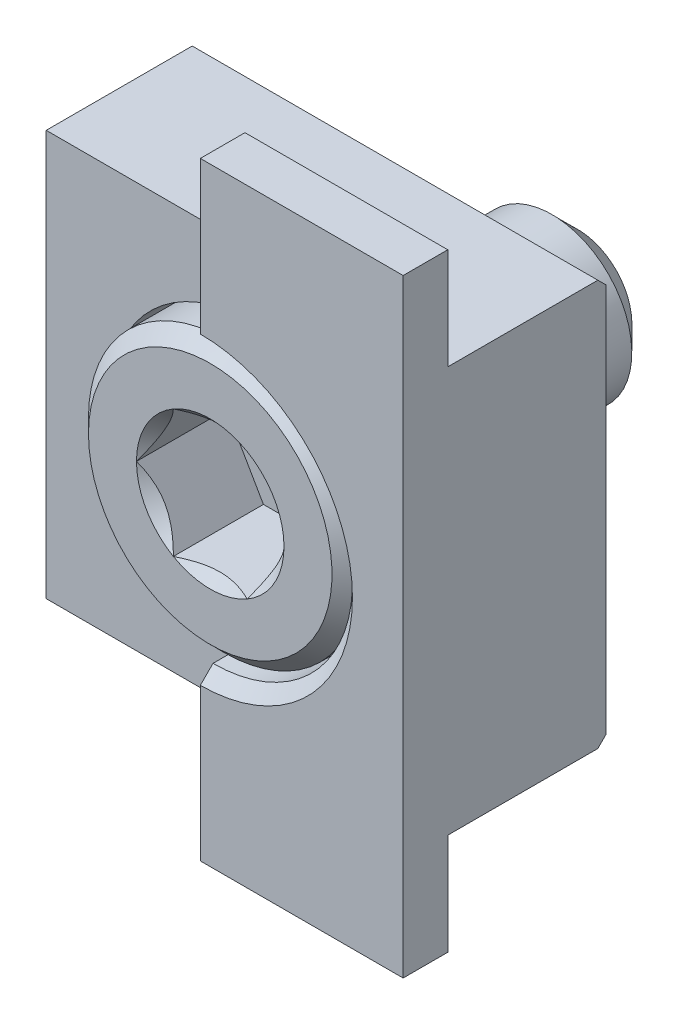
ISO-10303-21;
HEADER;
FILE_DESCRIPTION(('STEP AP214'),'2;1');
FILE_NAME('part.step','',(''),(''),'','','');
FILE_SCHEMA(('AUTOMOTIVE_DESIGN { 1 0 10303 214 1 1 1 1 }'));
ENDSEC;
DATA;
#1=APPLICATION_CONTEXT('core data for automotive mechanical design processes');
#2=APPLICATION_PROTOCOL_DEFINITION('international standard','automotive_design',2000,#1);
#3=PRODUCT_CONTEXT('',#1,'mechanical');
#4=PRODUCT('Part','Part','',(#3));
#5=PRODUCT_RELATED_PRODUCT_CATEGORY('part','',(#4));
#6=PRODUCT_DEFINITION_FORMATION('','',#4);
#7=PRODUCT_DEFINITION_CONTEXT('part definition',#1,'design');
#8=PRODUCT_DEFINITION('design','',#6,#7);
#9=PRODUCT_DEFINITION_SHAPE('','',#8);
#10=(LENGTH_UNIT() NAMED_UNIT(*) SI_UNIT(.MILLI.,.METRE.));
#11=(NAMED_UNIT(*) PLANE_ANGLE_UNIT() SI_UNIT($,.RADIAN.));
#12=(NAMED_UNIT(*) SI_UNIT($,.STERADIAN.) SOLID_ANGLE_UNIT());
#13=UNCERTAINTY_MEASURE_WITH_UNIT(LENGTH_MEASURE(1.E-05),#10,'distance_accuracy_value','');
#14=(GEOMETRIC_REPRESENTATION_CONTEXT(3) GLOBAL_UNCERTAINTY_ASSIGNED_CONTEXT((#13)) GLOBAL_UNIT_ASSIGNED_CONTEXT((#10,
#11,#12)) REPRESENTATION_CONTEXT('',''));
#15=CARTESIAN_POINT('',(0.,0.,0.));
#16=DIRECTION('',(0.,0.,1.));
#17=DIRECTION('',(1.,0.,0.));
#18=AXIS2_PLACEMENT_3D('',#15,#16,#17);
#19=CARTESIAN_POINT('',(6.35,-9.525,6.34746000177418));
#20=DIRECTION('',(-0.707106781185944,0.,-0.707106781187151));
#21=DIRECTION('',(0.,-1.,0.));
#22=AXIS2_PLACEMENT_3D('',#19,#20,#21);
#23=PLANE('',#22);
#24=DIRECTION('',(-0.707106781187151,0.,0.707106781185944));
#25=VECTOR('',#24,1.);
#26=CARTESIAN_POINT('',(6.35,9.525,6.34746000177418));
#27=LINE('',#26,#25);
#28=CARTESIAN_POINT('',(6.35,9.525,6.34746000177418));
#29=VERTEX_POINT('',#28);
#30=CARTESIAN_POINT('',(6.34746,9.525,6.35000000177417));
#31=VERTEX_POINT('',#30);
#32=EDGE_CURVE('E388',#29,#31,#27,.T.);
#33=ORIENTED_EDGE('',*,*,#32,.T.);
#34=DIRECTION('',(0.,1.,0.));
#35=VECTOR('',#34,1.);
#36=CARTESIAN_POINT('',(6.34746,-9.525,6.35000000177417));
#37=LINE('',#36,#35);
#38=CARTESIAN_POINT('',(6.34746,-9.525,6.35000000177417));
#39=VERTEX_POINT('',#38);
#40=EDGE_CURVE('E281',#39,#31,#37,.T.);
#41=ORIENTED_EDGE('',*,*,#40,.F.);
#42=DIRECTION('',(-0.707106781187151,0.,0.707106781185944));
#43=VECTOR('',#42,1.);
#44=CARTESIAN_POINT('',(6.35,-9.525,6.34746000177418));
#45=LINE('',#44,#43);
#46=CARTESIAN_POINT('',(6.35,-9.525,6.34746000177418));
#47=VERTEX_POINT('',#46);
#48=EDGE_CURVE('E297',#47,#39,#45,.T.);
#49=ORIENTED_EDGE('',*,*,#48,.F.);
#50=DIRECTION('',(0.,1.,0.));
#51=VECTOR('',#50,1.);
#52=CARTESIAN_POINT('',(6.35,-9.525,6.34746000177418));
#53=LINE('',#52,#51);
#54=EDGE_CURVE('E219',#47,#29,#53,.T.);
#55=ORIENTED_EDGE('',*,*,#54,.T.);
#56=EDGE_LOOP('',(#33,#41,#49,#55));
#57=FACE_BOUND('',#56,.T.);
#58=ADVANCED_FACE('F14',(#57),#23,.F.);
#59=CARTESIAN_POINT('',(6.35,-9.525,6.34746000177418));
#60=DIRECTION('',(-1.,0.,0.));
#61=DIRECTION('',(0.,1.,0.));
#62=AXIS2_PLACEMENT_3D('',#59,#60,#61);
#63=PLANE('',#62);
#64=DIRECTION('',(0.,1.,0.));
#65=VECTOR('',#64,1.);
#66=CARTESIAN_POINT('',(6.35,-9.525,0.00254000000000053));
#67=LINE('',#66,#65);
#68=CARTESIAN_POINT('',(6.35,-6.09854,0.00254000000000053));
#69=VERTEX_POINT('',#68);
#70=CARTESIAN_POINT('',(6.35,6.09854,0.00254000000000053));
#71=VERTEX_POINT('',#70);
#72=EDGE_CURVE('E343',#69,#71,#67,.T.);
#73=ORIENTED_EDGE('',*,*,#72,.T.);
#74=DIRECTION('',(0.,0.707106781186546,0.707106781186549));
#75=VECTOR('',#74,1.);
#76=CARTESIAN_POINT('',(6.35,6.35,0.254));
#77=LINE('',#76,#75);
#78=CARTESIAN_POINT('',(6.35,6.35,0.254));
#79=VERTEX_POINT('',#78);
#80=EDGE_CURVE('E348',#71,#79,#77,.T.);
#81=ORIENTED_EDGE('',*,*,#80,.T.);
#82=DIRECTION('',(0.,0.,1.));
#83=VECTOR('',#82,1.);
#84=CARTESIAN_POINT('',(6.35,6.35,4.95300000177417));
#85=LINE('',#84,#83);
#86=CARTESIAN_POINT('',(6.35,6.35,4.95300000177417));
#87=VERTEX_POINT('',#86);
#88=EDGE_CURVE('E344',#79,#87,#85,.T.);
#89=ORIENTED_EDGE('',*,*,#88,.T.);
#90=DIRECTION('',(0.,1.,0.));
#91=VECTOR('',#90,1.);
#92=CARTESIAN_POINT('',(6.35,9.525,4.95300000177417));
#93=LINE('',#92,#91);
#94=CARTESIAN_POINT('',(6.35,9.525,4.95300000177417));
#95=VERTEX_POINT('',#94);
#96=EDGE_CURVE('E349',#87,#95,#93,.T.);
#97=ORIENTED_EDGE('',*,*,#96,.T.);
#98=DIRECTION('',(0.,0.,1.));
#99=VECTOR('',#98,1.);
#100=CARTESIAN_POINT('',(6.35,9.525,6.34746000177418));
#101=LINE('',#100,#99);
#102=EDGE_CURVE('E317',#95,#29,#101,.T.);
#103=ORIENTED_EDGE('',*,*,#102,.T.);
#104=ORIENTED_EDGE('',*,*,#54,.F.);
#105=DIRECTION('',(0.,0.,1.));
#106=VECTOR('',#105,1.);
#107=CARTESIAN_POINT('',(6.35,-9.525,6.34746000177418));
#108=LINE('',#107,#106);
#109=CARTESIAN_POINT('',(6.35,-9.525,4.95300000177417));
#110=VERTEX_POINT('',#109);
#111=EDGE_CURVE('E230',#110,#47,#108,.T.);
#112=ORIENTED_EDGE('',*,*,#111,.F.);
#113=DIRECTION('',(0.,1.,0.));
#114=VECTOR('',#113,1.);
#115=CARTESIAN_POINT('',(6.35,-6.35,4.95300000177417));
#116=LINE('',#115,#114);
#117=CARTESIAN_POINT('',(6.35,-6.35,4.95300000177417));
#118=VERTEX_POINT('',#117);
#119=EDGE_CURVE('E313',#110,#118,#116,.T.);
#120=ORIENTED_EDGE('',*,*,#119,.T.);
#121=DIRECTION('',(0.,0.,-1.));
#122=VECTOR('',#121,1.);
#123=CARTESIAN_POINT('',(6.35,-6.35,4.95300000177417));
#124=LINE('',#123,#122);
#125=CARTESIAN_POINT('',(6.35,-6.35,0.254));
#126=VERTEX_POINT('',#125);
#127=EDGE_CURVE('E318',#118,#126,#124,.T.);
#128=ORIENTED_EDGE('',*,*,#127,.T.);
#129=DIRECTION('',(0.,0.707106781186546,-0.707106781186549));
#130=VECTOR('',#129,1.);
#131=CARTESIAN_POINT('',(6.35,-6.096,0.));
#132=LINE('',#131,#130);
#133=EDGE_CURVE('E384',#126,#69,#132,.T.);
#134=ORIENTED_EDGE('',*,*,#133,.T.);
#135=EDGE_LOOP('',(#73,#81,#89,#97,#103,#104,#112,#120,#128,#134));
#136=FACE_BOUND('',#135,.T.);
#137=ADVANCED_FACE('F745',(#136),#63,.F.);
#138=CARTESIAN_POINT('',(6.35,9.525,4.95300000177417));
#139=DIRECTION('',(0.,0.,1.));
#140=DIRECTION('',(0.,1.,0.));
#141=AXIS2_PLACEMENT_3D('',#138,#139,#140);
#142=PLANE('',#141);
#143=DIRECTION('',(-1.,0.,0.));
#144=VECTOR('',#143,1.);
#145=CARTESIAN_POINT('',(6.35,9.525,4.95300000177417));
#146=LINE('',#145,#144);
#147=CARTESIAN_POINT('',(0.,9.525,4.95300000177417));
#148=VERTEX_POINT('',#147);
#149=EDGE_CURVE('E417',#95,#148,#146,.T.);
#150=ORIENTED_EDGE('',*,*,#149,.F.);
#151=ORIENTED_EDGE('',*,*,#96,.F.);
#152=DIRECTION('',(-1.,0.,0.));
#153=VECTOR('',#152,1.);
#154=CARTESIAN_POINT('',(6.35,6.35,4.95300000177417));
#155=LINE('',#154,#153);
#156=CARTESIAN_POINT('',(0.,6.35,4.95300000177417));
#157=VERTEX_POINT('',#156);
#158=EDGE_CURVE('E289',#87,#157,#155,.T.);
#159=ORIENTED_EDGE('',*,*,#158,.T.);
#160=DIRECTION('',(0.,1.,0.));
#161=VECTOR('',#160,1.);
#162=CARTESIAN_POINT('',(0.,-9.525,4.95300000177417));
#163=LINE('',#162,#161);
#164=EDGE_CURVE('E292',#157,#148,#163,.T.);
#165=ORIENTED_EDGE('',*,*,#164,.T.);
#166=EDGE_LOOP('',(#150,#151,#159,#165));
#167=FACE_BOUND('',#166,.T.);
#168=ADVANCED_FACE('F725',(#167),#142,.F.);
#169=CARTESIAN_POINT('',(0.,9.525,3.17500000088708));
#170=DIRECTION('',(0.,1.,0.));
#171=DIRECTION('',(-1.,0.,0.));
#172=AXIS2_PLACEMENT_3D('',#169,#170,#171);
#173=PLANE('',#172);
#174=ORIENTED_EDGE('',*,*,#149,.T.);
#175=DIRECTION('',(0.,0.,-1.));
#176=VECTOR('',#175,1.);
#177=CARTESIAN_POINT('',(0.,9.525,4.95300000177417));
#178=LINE('',#177,#176);
#179=CARTESIAN_POINT('',(0.,9.525,6.35000000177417));
#180=VERTEX_POINT('',#179);
#181=EDGE_CURVE('E301',#180,#148,#178,.T.);
#182=ORIENTED_EDGE('',*,*,#181,.F.);
#183=DIRECTION('',(-1.,0.,0.));
#184=VECTOR('',#183,1.);
#185=CARTESIAN_POINT('',(6.34746,9.525,6.35000000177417));
#186=LINE('',#185,#184);
#187=EDGE_CURVE('E283',#31,#180,#186,.T.);
#188=ORIENTED_EDGE('',*,*,#187,.F.);
#189=ORIENTED_EDGE('',*,*,#32,.F.);
#190=ORIENTED_EDGE('',*,*,#102,.F.);
#191=EDGE_LOOP('',(#174,#182,#188,#189,#190));
#192=FACE_BOUND('',#191,.T.);
#193=ADVANCED_FACE('F721',(#192),#173,.T.);
#194=CARTESIAN_POINT('',(6.34746,-9.525,6.35000000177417));
#195=DIRECTION('',(0.,0.,-1.));
#196=DIRECTION('',(0.,-1.,0.));
#197=AXIS2_PLACEMENT_3D('',#194,#195,#196);
#198=PLANE('',#197);
#199=ORIENTED_EDGE('',*,*,#187,.T.);
#200=DIRECTION('',(0.,1.,0.));
#201=VECTOR('',#200,1.);
#202=CARTESIAN_POINT('',(0.,-9.525,6.35000000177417));
#203=LINE('',#202,#201);
#204=CARTESIAN_POINT('',(0.,4.7625,6.35000000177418));
#205=VERTEX_POINT('',#204);
#206=EDGE_CURVE('E305',#205,#180,#203,.T.);
#207=ORIENTED_EDGE('',*,*,#206,.F.);
#208=CARTESIAN_POINT('',(0.,0.,6.35000000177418));
#209=DIRECTION('',(0.,0.,1.));
#210=DIRECTION('',(0.,1.,0.));
#211=AXIS2_PLACEMENT_3D('',#208,#209,#210);
#212=CIRCLE('',#211,4.7625);
#213=CARTESIAN_POINT('',(0.,-4.7625,6.35000000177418));
#214=VERTEX_POINT('',#213);
#215=EDGE_CURVE('E354',#214,#205,#212,.T.);
#216=ORIENTED_EDGE('',*,*,#215,.F.);
#217=DIRECTION('',(0.,1.,0.));
#218=VECTOR('',#217,1.);
#219=CARTESIAN_POINT('',(0.,-9.525,6.35000000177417));
#220=LINE('',#219,#218);
#221=CARTESIAN_POINT('',(0.,-9.525,6.35000000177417));
#222=VERTEX_POINT('',#221);
#223=EDGE_CURVE('E306',#222,#214,#220,.T.);
#224=ORIENTED_EDGE('',*,*,#223,.F.);
#225=DIRECTION('',(-1.,0.,0.));
#226=VECTOR('',#225,1.);
#227=CARTESIAN_POINT('',(6.34746,-9.525,6.35000000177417));
#228=LINE('',#227,#226);
#229=EDGE_CURVE('E300',#39,#222,#228,.T.);
#230=ORIENTED_EDGE('',*,*,#229,.F.);
#231=ORIENTED_EDGE('',*,*,#40,.T.);
#232=EDGE_LOOP('',(#199,#207,#216,#224,#230,#231));
#233=FACE_BOUND('',#232,.T.);
#234=ADVANCED_FACE('F724',(#233),#198,.F.);
#235=CARTESIAN_POINT('',(0.,-9.525,3.17500000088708));
#236=DIRECTION('',(0.,1.,0.));
#237=DIRECTION('',(-1.,0.,0.));
#238=AXIS2_PLACEMENT_3D('',#235,#236,#237);
#239=PLANE('',#238);
#240=DIRECTION('',(0.,0.,-1.));
#241=VECTOR('',#240,1.);
#242=CARTESIAN_POINT('',(0.,-9.525,4.95300000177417));
#243=LINE('',#242,#241);
#244=CARTESIAN_POINT('',(0.,-9.525,4.95300000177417));
#245=VERTEX_POINT('',#244);
#246=EDGE_CURVE('E284',#222,#245,#243,.T.);
#247=ORIENTED_EDGE('',*,*,#246,.T.);
#248=DIRECTION('',(-1.,0.,0.));
#249=VECTOR('',#248,1.);
#250=CARTESIAN_POINT('',(6.35,-9.525,4.95300000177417));
#251=LINE('',#250,#249);
#252=EDGE_CURVE('E296',#110,#245,#251,.T.);
#253=ORIENTED_EDGE('',*,*,#252,.F.);
#254=ORIENTED_EDGE('',*,*,#111,.T.);
#255=ORIENTED_EDGE('',*,*,#48,.T.);
#256=ORIENTED_EDGE('',*,*,#229,.T.);
#257=EDGE_LOOP('',(#247,#253,#254,#255,#256));
#258=FACE_BOUND('',#257,.T.);
#259=ADVANCED_FACE('F729',(#258),#239,.F.);
#260=CARTESIAN_POINT('',(6.35,-6.35,4.95300000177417));
#261=DIRECTION('',(0.,0.,1.));
#262=DIRECTION('',(0.,1.,0.));
#263=AXIS2_PLACEMENT_3D('',#260,#261,#262);
#264=PLANE('',#263);
#265=DIRECTION('',(-1.,0.,0.));
#266=VECTOR('',#265,1.);
#267=CARTESIAN_POINT('',(6.35,-6.35,4.95300000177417));
#268=LINE('',#267,#266);
#269=CARTESIAN_POINT('',(0.,-6.35,4.95300000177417));
#270=VERTEX_POINT('',#269);
#271=EDGE_CURVE('E261',#118,#270,#268,.T.);
#272=ORIENTED_EDGE('',*,*,#271,.F.);
#273=ORIENTED_EDGE('',*,*,#119,.F.);
#274=ORIENTED_EDGE('',*,*,#252,.T.);
#275=DIRECTION('',(0.,1.,0.));
#276=VECTOR('',#275,1.);
#277=CARTESIAN_POINT('',(0.,-9.525,4.95300000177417));
#278=LINE('',#277,#276);
#279=EDGE_CURVE('E144',#245,#270,#278,.T.);
#280=ORIENTED_EDGE('',*,*,#279,.T.);
#281=EDGE_LOOP('',(#272,#273,#274,#280));
#282=FACE_BOUND('',#281,.T.);
#283=ADVANCED_FACE('F748',(#282),#264,.F.);
#284=CARTESIAN_POINT('',(6.35,-6.35,4.95300000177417));
#285=DIRECTION('',(0.,1.,0.));
#286=DIRECTION('',(-1.,0.,0.));
#287=AXIS2_PLACEMENT_3D('',#284,#285,#286);
#288=PLANE('',#287);
#289=ORIENTED_EDGE('',*,*,#271,.T.);
#290=DIRECTION('',(0.,0.,1.));
#291=VECTOR('',#290,1.);
#292=CARTESIAN_POINT('',(0.,-6.35,4.82600000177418));
#293=LINE('',#292,#291);
#294=CARTESIAN_POINT('',(0.,-6.35,4.82600000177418));
#295=VERTEX_POINT('',#294);
#296=EDGE_CURVE('E267',#295,#270,#293,.T.);
#297=ORIENTED_EDGE('',*,*,#296,.F.);
#298=DIRECTION('',(1.,0.,0.));
#299=VECTOR('',#298,1.);
#300=CARTESIAN_POINT('',(0.,-6.35,4.82600000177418));
#301=LINE('',#300,#299);
#302=CARTESIAN_POINT('',(-6.35,-6.35,4.82600000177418));
#303=VERTEX_POINT('',#302);
#304=EDGE_CURVE('E244',#303,#295,#301,.T.);
#305=ORIENTED_EDGE('',*,*,#304,.F.);
#306=DIRECTION('',(0.,0.,-1.));
#307=VECTOR('',#306,1.);
#308=CARTESIAN_POINT('',(-6.35,-6.35,4.95300000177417));
#309=LINE('',#308,#307);
#310=CARTESIAN_POINT('',(-6.35,-6.35,0.253999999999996));
#311=VERTEX_POINT('',#310);
#312=EDGE_CURVE('E252',#303,#311,#309,.T.);
#313=ORIENTED_EDGE('',*,*,#312,.T.);
#314=DIRECTION('',(1.,0.,0.));
#315=VECTOR('',#314,1.);
#316=CARTESIAN_POINT('',(6.35,-6.35,0.253999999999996));
#317=LINE('',#316,#315);
#318=EDGE_CURVE('E262',#311,#126,#317,.T.);
#319=ORIENTED_EDGE('',*,*,#318,.T.);
#320=ORIENTED_EDGE('',*,*,#127,.F.);
#321=EDGE_LOOP('',(#289,#297,#305,#313,#319,#320));
#322=FACE_BOUND('',#321,.T.);
#323=ADVANCED_FACE('F266',(#322),#288,.F.);
#324=CARTESIAN_POINT('',(-6.35,-9.525,6.34746000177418));
#325=DIRECTION('',(1.,0.,0.));
#326=DIRECTION('',(0.,0.,-1.));
#327=AXIS2_PLACEMENT_3D('',#324,#325,#326);
#328=PLANE('',#327);
#329=DIRECTION('',(0.,-1.,0.));
#330=VECTOR('',#329,1.);
#331=CARTESIAN_POINT('',(-6.35,-6.35,4.82600000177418));
#332=LINE('',#331,#330);
#333=CARTESIAN_POINT('',(-6.35,6.35,4.82600000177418));
#334=VERTEX_POINT('',#333);
#335=EDGE_CURVE('E239',#334,#303,#332,.T.);
#336=ORIENTED_EDGE('',*,*,#335,.F.);
#337=DIRECTION('',(0.,0.,1.));
#338=VECTOR('',#337,1.);
#339=CARTESIAN_POINT('',(-6.35,6.35,4.95300000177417));
#340=LINE('',#339,#338);
#341=CARTESIAN_POINT('',(-6.35,6.35,0.254));
#342=VERTEX_POINT('',#341);
#343=EDGE_CURVE('E285',#342,#334,#340,.T.);
#344=ORIENTED_EDGE('',*,*,#343,.F.);
#345=DIRECTION('',(0.,-0.707106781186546,-0.707106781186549));
#346=VECTOR('',#345,1.);
#347=CARTESIAN_POINT('',(-6.35,6.35,0.254));
#348=LINE('',#347,#346);
#349=CARTESIAN_POINT('',(-6.35,6.09854,0.00254000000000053));
#350=VERTEX_POINT('',#349);
#351=EDGE_CURVE('E376',#342,#350,#348,.T.);
#352=ORIENTED_EDGE('',*,*,#351,.T.);
#353=DIRECTION('',(0.,1.,0.));
#354=VECTOR('',#353,1.);
#355=CARTESIAN_POINT('',(-6.35,-9.525,0.00254000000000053));
#356=LINE('',#355,#354);
#357=CARTESIAN_POINT('',(-6.35,-6.09854,0.00254000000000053));
#358=VERTEX_POINT('',#357);
#359=EDGE_CURVE('E426',#358,#350,#356,.T.);
#360=ORIENTED_EDGE('',*,*,#359,.F.);
#361=DIRECTION('',(0.,-0.707106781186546,0.707106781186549));
#362=VECTOR('',#361,1.);
#363=CARTESIAN_POINT('',(-6.35,-6.096,0.));
#364=LINE('',#363,#362);
#365=EDGE_CURVE('E256',#358,#311,#364,.T.);
#366=ORIENTED_EDGE('',*,*,#365,.T.);
#367=ORIENTED_EDGE('',*,*,#312,.F.);
#368=EDGE_LOOP('',(#336,#344,#352,#360,#366,#367));
#369=FACE_BOUND('',#368,.T.);
#370=ADVANCED_FACE('F253',(#369),#328,.F.);
#371=CARTESIAN_POINT('',(6.35,6.35,4.95300000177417));
#372=DIRECTION('',(0.,-1.,0.));
#373=DIRECTION('',(0.,0.,1.));
#374=AXIS2_PLACEMENT_3D('',#371,#372,#373);
#375=PLANE('',#374);
#376=DIRECTION('',(-1.,0.,0.));
#377=VECTOR('',#376,1.);
#378=CARTESIAN_POINT('',(-6.35,6.35,4.82600000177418));
#379=LINE('',#378,#377);
#380=CARTESIAN_POINT('',(0.,6.35,4.82600000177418));
#381=VERTEX_POINT('',#380);
#382=EDGE_CURVE('E246',#381,#334,#379,.T.);
#383=ORIENTED_EDGE('',*,*,#382,.F.);
#384=DIRECTION('',(0.,0.,1.));
#385=VECTOR('',#384,1.);
#386=CARTESIAN_POINT('',(0.,6.35,4.82600000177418));
#387=LINE('',#386,#385);
#388=EDGE_CURVE('E309',#381,#157,#387,.T.);
#389=ORIENTED_EDGE('',*,*,#388,.T.);
#390=ORIENTED_EDGE('',*,*,#158,.F.);
#391=ORIENTED_EDGE('',*,*,#88,.F.);
#392=DIRECTION('',(-1.,0.,0.));
#393=VECTOR('',#392,1.);
#394=CARTESIAN_POINT('',(6.35,6.35,0.254));
#395=LINE('',#394,#393);
#396=EDGE_CURVE('E288',#79,#342,#395,.T.);
#397=ORIENTED_EDGE('',*,*,#396,.T.);
#398=ORIENTED_EDGE('',*,*,#343,.T.);
#399=EDGE_LOOP('',(#383,#389,#390,#391,#397,#398));
#400=FACE_BOUND('',#399,.T.);
#401=ADVANCED_FACE('F751',(#400),#375,.F.);
#402=CARTESIAN_POINT('',(0.,-9.525,4.95300000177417));
#403=DIRECTION('',(1.,0.,0.));
#404=DIRECTION('',(0.,0.,-1.));
#405=AXIS2_PLACEMENT_3D('',#402,#403,#404);
#406=PLANE('',#405);
#407=DIRECTION('',(0.,-0.707106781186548,-0.707106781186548));
#408=VECTOR('',#407,1.);
#409=CARTESIAN_POINT('',(0.,0.,1.58750000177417));
#410=LINE('',#409,#408);
#411=CARTESIAN_POINT('',(0.,4.365625,5.95312500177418));
#412=VERTEX_POINT('',#411);
#413=EDGE_CURVE('E350',#205,#412,#410,.T.);
#414=ORIENTED_EDGE('',*,*,#413,.F.);
#415=ORIENTED_EDGE('',*,*,#206,.T.);
#416=ORIENTED_EDGE('',*,*,#181,.T.);
#417=ORIENTED_EDGE('',*,*,#164,.F.);
#418=ORIENTED_EDGE('',*,*,#388,.F.);
#419=DIRECTION('',(0.,1.,0.));
#420=VECTOR('',#419,1.);
#421=CARTESIAN_POINT('',(0.,6.35,4.82600000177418));
#422=LINE('',#421,#420);
#423=CARTESIAN_POINT('',(0.,4.365625,4.82600000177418));
#424=VERTEX_POINT('',#423);
#425=EDGE_CURVE('E293',#424,#381,#422,.T.);
#426=ORIENTED_EDGE('',*,*,#425,.F.);
#427=DIRECTION('',(0.,0.,-1.));
#428=VECTOR('',#427,1.);
#429=CARTESIAN_POINT('',(0.,4.365625,6.35000000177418));
#430=LINE('',#429,#428);
#431=EDGE_CURVE('E330',#412,#424,#430,.T.);
#432=ORIENTED_EDGE('',*,*,#431,.F.);
#433=EDGE_LOOP('',(#414,#415,#416,#417,#418,#426,#432));
#434=FACE_BOUND('',#433,.T.);
#435=ADVANCED_FACE('F754',(#434),#406,.F.);
#436=CARTESIAN_POINT('',(0.,0.,6.35000000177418));
#437=DIRECTION('',(0.,0.,1.));
#438=DIRECTION('',(0.,1.,0.));
#439=AXIS2_PLACEMENT_3D('',#436,#437,#438);
#440=CONICAL_SURFACE('',#439,4.7625,0.785398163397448);
#441=ORIENTED_EDGE('',*,*,#215,.T.);
#442=ORIENTED_EDGE('',*,*,#413,.T.);
#443=CARTESIAN_POINT('',(0.,0.,5.95312500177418));
#444=DIRECTION('',(0.,0.,1.));
#445=DIRECTION('',(0.,1.,0.));
#446=AXIS2_PLACEMENT_3D('',#443,#444,#445);
#447=CIRCLE('',#446,4.365625);
#448=CARTESIAN_POINT('',(0.,-4.365625,5.95312500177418));
#449=VERTEX_POINT('',#448);
#450=EDGE_CURVE('E333',#449,#412,#447,.T.);
#451=ORIENTED_EDGE('',*,*,#450,.F.);
#452=DIRECTION('',(0.,-0.707106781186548,0.707106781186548));
#453=VECTOR('',#452,1.);
#454=CARTESIAN_POINT('',(0.,0.,1.58750000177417));
#455=LINE('',#454,#453);
#456=EDGE_CURVE('E355',#449,#214,#455,.T.);
#457=ORIENTED_EDGE('',*,*,#456,.T.);
#458=EDGE_LOOP('',(#441,#442,#451,#457));
#459=FACE_BOUND('',#458,.T.);
#460=ADVANCED_FACE('F765',(#459),#440,.F.);
#461=CARTESIAN_POINT('',(0.,-9.525,4.95300000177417));
#462=DIRECTION('',(1.,0.,0.));
#463=DIRECTION('',(0.,0.,-1.));
#464=AXIS2_PLACEMENT_3D('',#461,#462,#463);
#465=PLANE('',#464);
#466=ORIENTED_EDGE('',*,*,#279,.F.);
#467=ORIENTED_EDGE('',*,*,#246,.F.);
#468=ORIENTED_EDGE('',*,*,#223,.T.);
#469=ORIENTED_EDGE('',*,*,#456,.F.);
#470=DIRECTION('',(0.,0.,1.));
#471=VECTOR('',#470,1.);
#472=CARTESIAN_POINT('',(0.,-4.365625,6.35000000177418));
#473=LINE('',#472,#471);
#474=CARTESIAN_POINT('',(0.,-4.365625,4.82600000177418));
#475=VERTEX_POINT('',#474);
#476=EDGE_CURVE('E24',#475,#449,#473,.T.);
#477=ORIENTED_EDGE('',*,*,#476,.F.);
#478=DIRECTION('',(0.,1.,0.));
#479=VECTOR('',#478,1.);
#480=CARTESIAN_POINT('',(0.,-4.365625,4.82600000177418));
#481=LINE('',#480,#479);
#482=EDGE_CURVE('E269',#295,#475,#481,.T.);
#483=ORIENTED_EDGE('',*,*,#482,.F.);
#484=ORIENTED_EDGE('',*,*,#296,.T.);
#485=EDGE_LOOP('',(#466,#467,#468,#469,#477,#483,#484));
#486=FACE_BOUND('',#485,.T.);
#487=ADVANCED_FACE('F762',(#486),#465,.F.);
#488=CARTESIAN_POINT('',(0.,0.,4.82600000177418));
#489=DIRECTION('',(0.,0.,1.));
#490=DIRECTION('',(0.,1.,0.));
#491=AXIS2_PLACEMENT_3D('',#488,#489,#490);
#492=PLANE('',#491);
#493=CARTESIAN_POINT('',(0.,0.,4.82600000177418));
#494=DIRECTION('',(0.,0.,-1.));
#495=DIRECTION('',(0.,1.,0.));
#496=AXIS2_PLACEMENT_3D('',#493,#494,#495);
#497=CIRCLE('',#496,4.365625);
#498=EDGE_CURVE('E39',#475,#424,#497,.T.);
#499=ORIENTED_EDGE('',*,*,#498,.T.);
#500=ORIENTED_EDGE('',*,*,#425,.T.);
#501=ORIENTED_EDGE('',*,*,#382,.T.);
#502=ORIENTED_EDGE('',*,*,#335,.T.);
#503=ORIENTED_EDGE('',*,*,#304,.T.);
#504=ORIENTED_EDGE('',*,*,#482,.T.);
#505=EDGE_LOOP('',(#499,#500,#501,#502,#503,#504));
#506=FACE_BOUND('',#505,.T.);
#507=ADVANCED_FACE('F241',(#506),#492,.T.);
#508=CARTESIAN_POINT('',(0.,0.,6.35000000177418));
#509=DIRECTION('',(0.,0.,1.));
#510=DIRECTION('',(0.,1.,0.));
#511=AXIS2_PLACEMENT_3D('',#508,#509,#510);
#512=CYLINDRICAL_SURFACE('',#511,4.365625);
#513=ORIENTED_EDGE('',*,*,#431,.T.);
#514=ORIENTED_EDGE('',*,*,#498,.F.);
#515=ORIENTED_EDGE('',*,*,#476,.T.);
#516=ORIENTED_EDGE('',*,*,#450,.T.);
#517=EDGE_LOOP('',(#513,#514,#515,#516));
#518=FACE_BOUND('',#517,.T.);
#519=CARTESIAN_POINT('',(0.,0.,2.54000000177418));
#520=DIRECTION('',(0.,0.,1.));
#521=DIRECTION('',(0.,1.,0.));
#522=AXIS2_PLACEMENT_3D('',#519,#520,#521);
#523=CIRCLE('',#522,4.365625);
#524=CARTESIAN_POINT('',(0.,4.365625,2.54000000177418));
#525=VERTEX_POINT('',#524);
#526=EDGE_CURVE('E409',#525,#525,#523,.T.);
#527=ORIENTED_EDGE('',*,*,#526,.F.);
#528=EDGE_LOOP('',(#527));
#529=FACE_BOUND('',#528,.T.);
#530=ADVANCED_FACE('F735',(#518,#529),#512,.F.);
#531=CARTESIAN_POINT('',(0.,4.365625,2.54000000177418));
#532=DIRECTION('',(0.,0.,-1.));
#533=DIRECTION('',(1.,0.,0.));
#534=AXIS2_PLACEMENT_3D('',#531,#532,#533);
#535=PLANE('',#534);
#536=CARTESIAN_POINT('',(0.,0.,2.54000000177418));
#537=DIRECTION('',(0.,0.,-1.));
#538=DIRECTION('',(0.,-1.,0.));
#539=AXIS2_PLACEMENT_3D('',#536,#537,#538);
#540=CIRCLE('',#539,4.25);
#541=CARTESIAN_POINT('',(0.,-4.25,2.54000000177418));
#542=VERTEX_POINT('',#541);
#543=EDGE_CURVE('E9',#542,#542,#540,.T.);
#544=ORIENTED_EDGE('',*,*,#543,.T.);
#545=EDGE_LOOP('',(#544));
#546=FACE_BOUND('',#545,.T.);
#547=ORIENTED_EDGE('',*,*,#526,.T.);
#548=EDGE_LOOP('',(#547));
#549=FACE_BOUND('',#548,.T.);
#550=ADVANCED_FACE('F738',(#546,#549),#535,.F.);
#551=CARTESIAN_POINT('',(6.34746,-6.096,0.));
#552=DIRECTION('',(0.,0.707106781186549,0.707106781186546));
#553=DIRECTION('',(1.,0.,0.));
#554=AXIS2_PLACEMENT_3D('',#551,#552,#553);
#555=PLANE('',#554);
#556=ORIENTED_EDGE('',*,*,#133,.F.);
#557=ORIENTED_EDGE('',*,*,#318,.F.);
#558=ORIENTED_EDGE('',*,*,#365,.F.);
#559=DIRECTION('',(-0.57735026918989,-0.577350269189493,0.577350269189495));
#560=VECTOR('',#559,1.);
#561=CARTESIAN_POINT('',(-2.11581999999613,-1.86435999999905,-4.23164000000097));
#562=LINE('',#561,#560);
#563=CARTESIAN_POINT('',(-6.34746,-6.096,0.));
#564=VERTEX_POINT('',#563);
#565=EDGE_CURVE('E319',#564,#358,#562,.T.);
#566=ORIENTED_EDGE('',*,*,#565,.F.);
#567=DIRECTION('',(-1.,0.,0.));
#568=VECTOR('',#567,1.);
#569=CARTESIAN_POINT('',(6.34746,-6.096,0.));
#570=LINE('',#569,#568);
#571=CARTESIAN_POINT('',(6.34746,-6.096,0.));
#572=VERTEX_POINT('',#571);
#573=EDGE_CURVE('E279',#572,#564,#570,.T.);
#574=ORIENTED_EDGE('',*,*,#573,.F.);
#575=DIRECTION('',(-0.57735026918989,0.577350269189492,-0.577350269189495));
#576=VECTOR('',#575,1.);
#577=CARTESIAN_POINT('',(6.34746,-6.096,0.));
#578=LINE('',#577,#576);
#579=EDGE_CURVE('E339',#69,#572,#578,.T.);
#580=ORIENTED_EDGE('',*,*,#579,.F.);
#581=EDGE_LOOP('',(#556,#557,#558,#566,#574,#580));
#582=FACE_BOUND('',#581,.T.);
#583=ADVANCED_FACE('F739',(#582),#555,.F.);
#584=CARTESIAN_POINT('',(6.35,-9.525,0.00254000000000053));
#585=DIRECTION('',(-0.707106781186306,0.,0.707106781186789));
#586=DIRECTION('',(0.,1.,0.));
#587=AXIS2_PLACEMENT_3D('',#584,#585,#586);
#588=PLANE('',#587);
#589=DIRECTION('',(0.,1.,0.));
#590=VECTOR('',#589,1.);
#591=CARTESIAN_POINT('',(6.34746,-9.525,0.));
#592=LINE('',#591,#590);
#593=CARTESIAN_POINT('',(6.34746,6.096,0.));
#594=VERTEX_POINT('',#593);
#595=EDGE_CURVE('E325',#572,#594,#592,.T.);
#596=ORIENTED_EDGE('',*,*,#595,.T.);
#597=DIRECTION('',(0.57735026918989,0.577350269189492,0.577350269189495));
#598=VECTOR('',#597,1.);
#599=CARTESIAN_POINT('',(6.51764,6.26617999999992,0.170179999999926));
#600=LINE('',#599,#598);
#601=EDGE_CURVE('E329',#594,#71,#600,.T.);
#602=ORIENTED_EDGE('',*,*,#601,.T.);
#603=ORIENTED_EDGE('',*,*,#72,.F.);
#604=ORIENTED_EDGE('',*,*,#579,.T.);
#605=EDGE_LOOP('',(#596,#602,#603,#604));
#606=FACE_BOUND('',#605,.T.);
#607=ADVANCED_FACE('F733',(#606),#588,.F.);
#608=CARTESIAN_POINT('',(6.35,6.35,0.254));
#609=DIRECTION('',(0.,-0.707106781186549,0.707106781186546));
#610=DIRECTION('',(-1.,0.,0.));
#611=AXIS2_PLACEMENT_3D('',#608,#609,#610);
#612=PLANE('',#611);
#613=ORIENTED_EDGE('',*,*,#601,.F.);
#614=DIRECTION('',(1.,0.,0.));
#615=VECTOR('',#614,1.);
#616=CARTESIAN_POINT('',(6.34746,6.096,0.));
#617=LINE('',#616,#615);
#618=CARTESIAN_POINT('',(-6.34746,6.096,0.));
#619=VERTEX_POINT('',#618);
#620=EDGE_CURVE('E397',#619,#594,#617,.T.);
#621=ORIENTED_EDGE('',*,*,#620,.F.);
#622=DIRECTION('',(0.57735026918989,-0.577350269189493,-0.577350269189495));
#623=VECTOR('',#622,1.);
#624=CARTESIAN_POINT('',(-2.28430666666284,2.03284666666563,-4.06315333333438));
#625=LINE('',#624,#623);
#626=EDGE_CURVE('E323',#350,#619,#625,.T.);
#627=ORIENTED_EDGE('',*,*,#626,.F.);
#628=ORIENTED_EDGE('',*,*,#351,.F.);
#629=ORIENTED_EDGE('',*,*,#396,.F.);
#630=ORIENTED_EDGE('',*,*,#80,.F.);
#631=EDGE_LOOP('',(#613,#621,#627,#628,#629,#630));
#632=FACE_BOUND('',#631,.T.);
#633=ADVANCED_FACE('F716',(#632),#612,.F.);
#634=CARTESIAN_POINT('',(-6.34746,-9.525,0.));
#635=DIRECTION('',(0.707106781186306,0.,0.707106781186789));
#636=DIRECTION('',(0.,-1.,0.));
#637=AXIS2_PLACEMENT_3D('',#634,#635,#636);
#638=PLANE('',#637);
#639=ORIENTED_EDGE('',*,*,#359,.T.);
#640=ORIENTED_EDGE('',*,*,#626,.T.);
#641=DIRECTION('',(0.,1.,0.));
#642=VECTOR('',#641,1.);
#643=CARTESIAN_POINT('',(-6.34746,-9.525,0.));
#644=LINE('',#643,#642);
#645=EDGE_CURVE('E324',#564,#619,#644,.T.);
#646=ORIENTED_EDGE('',*,*,#645,.F.);
#647=ORIENTED_EDGE('',*,*,#565,.T.);
#648=EDGE_LOOP('',(#639,#640,#646,#647));
#649=FACE_BOUND('',#648,.T.);
#650=ADVANCED_FACE('F712',(#649),#638,.F.);
#651=CARTESIAN_POINT('',(6.34746,-9.525,0.));
#652=DIRECTION('',(0.,0.,1.));
#653=DIRECTION('',(0.,1.,0.));
#654=AXIS2_PLACEMENT_3D('',#651,#652,#653);
#655=PLANE('',#654);
#656=ORIENTED_EDGE('',*,*,#645,.T.);
#657=ORIENTED_EDGE('',*,*,#620,.T.);
#658=ORIENTED_EDGE('',*,*,#595,.F.);
#659=ORIENTED_EDGE('',*,*,#573,.T.);
#660=EDGE_LOOP('',(#656,#657,#658,#659));
#661=FACE_BOUND('',#660,.T.);
#662=CARTESIAN_POINT('',(0.,0.,0.));
#663=DIRECTION('',(0.,0.,1.));
#664=DIRECTION('',(0.,1.,0.));
#665=AXIS2_PLACEMENT_3D('',#662,#663,#664);
#666=CIRCLE('',#665,2.5527);
#667=CARTESIAN_POINT('',(0.,2.5527,0.));
#668=VERTEX_POINT('',#667);
#669=EDGE_CURVE('E328',#668,#668,#666,.T.);
#670=ORIENTED_EDGE('',*,*,#669,.T.);
#671=EDGE_LOOP('',(#670));
#672=FACE_BOUND('',#671,.T.);
#673=ADVANCED_FACE('F715',(#661,#672),#655,.F.);
#674=CARTESIAN_POINT('',(0.,0.,6.35000000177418));
#675=DIRECTION('',(0.,0.,1.));
#676=DIRECTION('',(0.,1.,0.));
#677=AXIS2_PLACEMENT_3D('',#674,#675,#676);
#678=CYLINDRICAL_SURFACE('',#677,2.5527);
#679=CARTESIAN_POINT('',(0.,0.,2.54000000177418));
#680=DIRECTION('',(0.,0.,1.));
#681=DIRECTION('',(0.,1.,0.));
#682=AXIS2_PLACEMENT_3D('',#679,#680,#681);
#683=CIRCLE('',#682,2.5527);
#684=CARTESIAN_POINT('',(0.,2.5527,2.54000000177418));
#685=VERTEX_POINT('',#684);
#686=EDGE_CURVE('E334',#685,#685,#683,.T.);
#687=ORIENTED_EDGE('',*,*,#686,.T.);
#688=EDGE_LOOP('',(#687));
#689=FACE_BOUND('',#688,.T.);
#690=ORIENTED_EDGE('',*,*,#669,.F.);
#691=EDGE_LOOP('',(#690));
#692=FACE_BOUND('',#691,.T.);
#693=ADVANCED_FACE('F664',(#689,#692),#678,.F.);
#694=CARTESIAN_POINT('',(-2.3094010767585,0.,3.22000000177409));
#695=DIRECTION('',(0.,0.,-1.));
#696=DIRECTION('',(-1.,0.,0.));
#697=AXIS2_PLACEMENT_3D('',#694,#695,#696);
#698=PLANE('',#697);
#699=DIRECTION('',(-0.5,0.86602540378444,0.));
#700=VECTOR('',#699,1.);
#701=CARTESIAN_POINT('',(-1.15470053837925,-2.,3.22000000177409));
#702=LINE('',#701,#700);
#703=CARTESIAN_POINT('',(-1.15470053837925,-2.,3.22000000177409));
#704=VERTEX_POINT('',#703);
#705=CARTESIAN_POINT('',(-2.3094010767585,0.,3.22000000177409));
#706=VERTEX_POINT('',#705);
#707=EDGE_CURVE('E467',#704,#706,#702,.T.);
#708=ORIENTED_EDGE('',*,*,#707,.F.);
#709=DIRECTION('',(-1.,0.,0.));
#710=VECTOR('',#709,1.);
#711=CARTESIAN_POINT('',(1.15470053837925,-2.,3.22000000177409));
#712=LINE('',#711,#710);
#713=CARTESIAN_POINT('',(1.15470053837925,-2.,3.22000000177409));
#714=VERTEX_POINT('',#713);
#715=EDGE_CURVE('E475',#714,#704,#712,.T.);
#716=ORIENTED_EDGE('',*,*,#715,.F.);
#717=DIRECTION('',(-0.5,-0.866025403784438,0.));
#718=VECTOR('',#717,1.);
#719=CARTESIAN_POINT('',(2.30940107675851,0.,3.22000000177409));
#720=LINE('',#719,#718);
#721=CARTESIAN_POINT('',(2.30940107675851,0.,3.22000000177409));
#722=VERTEX_POINT('',#721);
#723=EDGE_CURVE('E455',#722,#714,#720,.T.);
#724=ORIENTED_EDGE('',*,*,#723,.F.);
#725=DIRECTION('',(0.5,-0.86602540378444,0.));
#726=VECTOR('',#725,1.);
#727=CARTESIAN_POINT('',(1.15470053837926,2.,3.22000000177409));
#728=LINE('',#727,#726);
#729=CARTESIAN_POINT('',(1.15470053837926,2.,3.22000000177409));
#730=VERTEX_POINT('',#729);
#731=EDGE_CURVE('E464',#730,#722,#728,.T.);
#732=ORIENTED_EDGE('',*,*,#731,.F.);
#733=DIRECTION('',(1.,0.,0.));
#734=VECTOR('',#733,1.);
#735=CARTESIAN_POINT('',(-1.15470053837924,2.,3.22000000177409));
#736=LINE('',#735,#734);
#737=CARTESIAN_POINT('',(-1.15470053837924,2.,3.22000000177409));
#738=VERTEX_POINT('',#737);
#739=EDGE_CURVE('E460',#738,#730,#736,.T.);
#740=ORIENTED_EDGE('',*,*,#739,.F.);
#741=DIRECTION('',(0.5,0.866025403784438,0.));
#742=VECTOR('',#741,1.);
#743=CARTESIAN_POINT('',(-2.3094010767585,0.,3.22000000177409));
#744=LINE('',#743,#742);
#745=EDGE_CURVE('E444',#706,#738,#744,.T.);
#746=ORIENTED_EDGE('',*,*,#745,.F.);
#747=EDGE_LOOP('',(#708,#716,#724,#732,#740,#746));
#748=FACE_BOUND('',#747,.T.);
#749=ADVANCED_FACE('F560',(#748),#698,.F.);
#750=CARTESIAN_POINT('',(-1.15470053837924,2.,3.22000000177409));
#751=DIRECTION('',(0.,-1.,0.));
#752=DIRECTION('',(1.,0.,0.));
#753=AXIS2_PLACEMENT_3D('',#750,#751,#752);
#754=PLANE('',#753);
#755=CARTESIAN_POINT('',(-1.15470053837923,2.,6.04000000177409));
#756=CARTESIAN_POINT('',(-1.10743768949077,1.99999796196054,6.0163735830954));
#757=CARTESIAN_POINT('',(-1.05973357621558,1.99998852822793,5.99359476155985));
#758=CARTESIAN_POINT('',(-0.96513838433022,1.99997057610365,5.95088062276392));
#759=CARTESIAN_POINT('',(-0.918280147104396,1.99996203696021,5.93087232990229));
#760=CARTESIAN_POINT('',(-0.825155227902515,1.99995931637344,5.89368841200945));
#761=CARTESIAN_POINT('',(-0.77891645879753,1.99996469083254,5.87644337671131));
#762=CARTESIAN_POINT('',(-0.686783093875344,1.9999888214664,5.84478991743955));
#763=CARTESIAN_POINT('',(-0.64090962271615,2.00000723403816,5.83032053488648));
#764=CARTESIAN_POINT('',(-0.56961967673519,1.99999608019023,5.80999159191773));
#765=CARTESIAN_POINT('',(-0.544459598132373,1.99998463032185,5.80322455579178));
#766=CARTESIAN_POINT('',(-0.494366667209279,1.99994893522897,5.79060300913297));
#767=CARTESIAN_POINT('',(-0.469437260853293,1.99992491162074,5.78473490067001));
#768=CARTESIAN_POINT('',(-0.419748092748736,1.99988137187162,5.77391347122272));
#769=CARTESIAN_POINT('',(-0.394990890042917,1.99986179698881,5.76894842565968));
#770=CARTESIAN_POINT('',(-0.34558675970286,1.99983446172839,5.75993001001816));
#771=CARTESIAN_POINT('',(-0.320941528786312,1.99982657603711,5.75586737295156));
#772=CARTESIAN_POINT('',(-0.271700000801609,1.99982595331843,5.7486514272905));
#773=CARTESIAN_POINT('',(-0.247104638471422,1.99983310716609,5.74549175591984));
#774=CARTESIAN_POINT('',(-0.197899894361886,1.99986001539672,5.74007860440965));
#775=CARTESIAN_POINT('',(-0.173290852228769,1.99987972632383,5.73782204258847));
#776=CARTESIAN_POINT('',(-0.123994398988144,1.99992359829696,5.73421177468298));
#777=CARTESIAN_POINT('',(-0.0993069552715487,1.99994776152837,5.73285851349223));
#778=CARTESIAN_POINT('',(-0.0497884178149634,1.99998623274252,5.73105108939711));
#779=CARTESIAN_POINT('',(-0.0249571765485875,2.00000049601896,5.73060098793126));
#780=CARTESIAN_POINT('',(0.0246985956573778,1.99999950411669,5.73059687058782));
#781=CARTESIAN_POINT('',(0.0495231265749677,1.99998425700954,5.73104260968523));
#782=CARTESIAN_POINT('',(0.0990301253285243,1.9999447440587,5.7328418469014));
#783=CARTESIAN_POINT('',(0.123712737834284,1.99992051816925,5.73419134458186));
#784=CARTESIAN_POINT('',(0.173001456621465,1.99987692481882,5.73779432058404));
#785=CARTESIAN_POINT('',(0.197607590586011,1.99985755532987,5.74004742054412));
#786=CARTESIAN_POINT('',(0.246808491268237,1.99983158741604,5.74545395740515));
#787=CARTESIAN_POINT('',(0.271402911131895,1.99982503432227,5.74861054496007));
#788=CARTESIAN_POINT('',(0.320644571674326,1.99982687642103,5.75582061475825));
#789=CARTESIAN_POINT('',(0.345290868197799,1.99983538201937,5.75988052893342));
#790=CARTESIAN_POINT('',(0.394699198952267,1.99986373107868,5.76889377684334));
#791=CARTESIAN_POINT('',(0.419459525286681,1.99988369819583,5.77385644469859));
#792=CARTESIAN_POINT('',(0.469157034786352,1.99992764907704,5.78467347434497));
#793=CARTESIAN_POINT('',(0.494091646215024,1.99995168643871,5.79053962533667));
#794=CARTESIAN_POINT('',(0.544197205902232,1.9999864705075,5.80315732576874));
#795=CARTESIAN_POINT('',(0.569364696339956,1.99999697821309,5.80992252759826));
#796=CARTESIAN_POINT('',(0.640676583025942,2.00000557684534,5.83024750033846));
#797=CARTESIAN_POINT('',(0.686564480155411,1.99998565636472,5.84471562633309));
#798=CARTESIAN_POINT('',(0.778730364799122,1.99996032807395,5.87637137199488));
#799=CARTESIAN_POINT('',(0.824987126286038,1.99995531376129,5.8936202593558));
#800=CARTESIAN_POINT('',(0.91815263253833,1.99995920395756,5.93081610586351));
#801=CARTESIAN_POINT('',(0.96503334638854,1.999968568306,5.95083277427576));
#802=CARTESIAN_POINT('',(1.05967873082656,1.99998793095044,5.99356807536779));
#803=CARTESIAN_POINT('',(1.10741043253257,1.99999793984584,6.01635997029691));
#804=CARTESIAN_POINT('',(1.1547005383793,1.99999999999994,6.04000000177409));
#805=B_SPLINE_CURVE_WITH_KNOTS('',3,(#755,#756,#757,#758,#759,#760,#761,#762,#763,#764,#765,
#766,#767,#768,#769,#770,#771,#772,#773,#774,#775,#776,#777,#778,#779,#780,#781,#782,#783,#784,
#785,#786,#787,#788,#789,#790,#791,#792,#793,#794,#795,#796,#797,#798,#799,#800,#801,#802,#803,
#804),.UNSPECIFIED.,.F.,.F.,(4,2,2,2,2,2,2,2,2,2,2,2,2,2,2,2,2,2,2,2,2,2,2,2,4),(0.,
0.158532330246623,0.311340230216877,0.459331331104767,0.603560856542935,0.681712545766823,
0.758530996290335,0.834267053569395,0.90918515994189,0.98356154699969,1.05768193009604,
1.13183879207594,1.20632839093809,1.28079761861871,1.35493937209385,1.42905011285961,
1.50342250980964,1.57834244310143,1.65408628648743,1.73091860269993,1.80909033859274,
1.95335983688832,2.10140540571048,2.25428512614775,2.41290893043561),.UNSPECIFIED.);
#806=CARTESIAN_POINT('',(-1.15470053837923,2.,6.04000000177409));
#807=VERTEX_POINT('',#806);
#808=CARTESIAN_POINT('',(1.1547005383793,1.99999999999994,6.04000000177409));
#809=VERTEX_POINT('',#808);
#810=EDGE_CURVE('E541',#807,#809,#805,.T.);
#811=ORIENTED_EDGE('',*,*,#810,.F.);
#812=DIRECTION('',(0.,0.,1.));
#813=VECTOR('',#812,1.);
#814=CARTESIAN_POINT('',(-1.15470053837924,2.,3.22000000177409));
#815=LINE('',#814,#813);
#816=EDGE_CURVE('E448',#738,#807,#815,.T.);
#817=ORIENTED_EDGE('',*,*,#816,.F.);
#818=ORIENTED_EDGE('',*,*,#739,.T.);
#819=DIRECTION('',(0.,0.,1.));
#820=VECTOR('',#819,1.);
#821=CARTESIAN_POINT('',(1.15470053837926,2.,3.22000000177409));
#822=LINE('',#821,#820);
#823=EDGE_CURVE('E447',#730,#809,#822,.T.);
#824=ORIENTED_EDGE('',*,*,#823,.T.);
#825=EDGE_LOOP('',(#811,#817,#818,#824));
#826=FACE_BOUND('',#825,.T.);
#827=ADVANCED_FACE('F549',(#826),#754,.T.);
#828=CARTESIAN_POINT('',(-2.3094010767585,0.,3.22000000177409));
#829=DIRECTION('',(0.866025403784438,-0.5,0.));
#830=DIRECTION('',(-0.5,-0.866025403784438,0.));
#831=AXIS2_PLACEMENT_3D('',#828,#829,#830);
#832=PLANE('',#831);
#833=CARTESIAN_POINT('',(-2.3094010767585,0.,6.04000000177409));
#834=CARTESIAN_POINT('',(-2.28593687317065,0.0406372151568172,6.01654238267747));
#835=CARTESIAN_POINT('',(-2.26224907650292,0.0816475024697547,5.99392067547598));
#836=CARTESIAN_POINT('',(-2.21527488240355,0.162974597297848,5.95147821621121));
#837=CARTESIAN_POINT('',(-2.19200453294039,0.203263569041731,5.93158612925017));
#838=CARTESIAN_POINT('',(-2.14576830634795,0.283341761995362,5.89459236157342));
#839=CARTESIAN_POINT('',(-2.12281574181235,0.32310707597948,5.87742276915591));
#840=CARTESIAN_POINT('',(-2.07709370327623,0.402346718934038,5.84587799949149));
#841=CARTESIAN_POINT('',(-2.05433433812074,0.441802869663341,5.83144301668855));
#842=CARTESIAN_POINT('',(-2.0188460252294,0.503248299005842,5.81108491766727));
#843=CARTESIAN_POINT('',(-2.00625846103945,0.525027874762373,5.80427447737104));
#844=CARTESIAN_POINT('',(-1.98118594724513,0.56838378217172,5.79156504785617));
#845=CARTESIAN_POINT('',(-1.96870292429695,0.589957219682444,5.78565246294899));
#846=CARTESIAN_POINT('',(-1.94382572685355,0.632959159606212,5.77474101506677));
#847=CARTESIAN_POINT('',(-1.93143279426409,0.654385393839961,5.76973040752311));
#848=CARTESIAN_POINT('',(-1.90671249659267,0.697147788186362,5.76061982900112));
#849=CARTESIAN_POINT('',(-1.89438588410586,0.718482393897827,5.75651054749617));
#850=CARTESIAN_POINT('',(-1.8697705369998,0.761116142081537,5.74920029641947));
#851=CARTESIAN_POINT('',(-1.85748218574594,0.782414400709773,5.74599289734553));
#852=CARTESIAN_POINT('',(-1.83290979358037,0.825028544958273,5.74048330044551));
#853=CARTESIAN_POINT('',(-1.82062589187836,0.84634410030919,5.73817793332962));
#854=CARTESIAN_POINT('',(-1.79602328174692,0.889044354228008,5.73446907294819));
#855=CARTESIAN_POINT('',(-1.78370456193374,0.910429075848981,5.73306592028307));
#856=CARTESIAN_POINT('',(-1.75898746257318,0.953316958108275,5.73115779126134));
#857=CARTESIAN_POINT('',(-1.74658896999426,0.974820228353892,5.73065676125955));
#858=CARTESIAN_POINT('',(-1.72175050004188,1.01783959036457,5.73055006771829));
#859=CARTESIAN_POINT('',(-1.70931049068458,1.03935566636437,5.73094548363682));
#860=CARTESIAN_POINT('',(-1.68449435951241,1.08225889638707,5.73264661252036));
#861=CARTESIAN_POINT('',(-1.67211820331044,1.10364619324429,5.73394819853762));
#862=CARTESIAN_POINT('',(-1.64740900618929,1.14635590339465,5.73745791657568));
#863=CARTESIAN_POINT('',(-1.6350759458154,1.16767834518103,5.73966556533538));
#864=CARTESIAN_POINT('',(-1.61042711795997,1.21031900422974,5.74498372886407));
#865=CARTESIAN_POINT('',(-1.59811155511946,1.23163695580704,5.74809731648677));
#866=CARTESIAN_POINT('',(-1.5734673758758,1.2743256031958,5.75522389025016));
#867=CARTESIAN_POINT('',(-1.56113931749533,1.29569555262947,5.75924326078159));
#868=CARTESIAN_POINT('',(-1.53643537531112,1.33854115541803,5.7681778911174));
#869=CARTESIAN_POINT('',(-1.52406044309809,1.36001540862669,5.77310246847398));
#870=CARTESIAN_POINT('',(-1.49922562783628,1.40311915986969,5.78384576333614));
#871=CARTESIAN_POINT('',(-1.48676706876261,1.42474647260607,5.78967628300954));
#872=CARTESIAN_POINT('',(-1.46171999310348,1.46819942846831,5.80222511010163));
#873=CARTESIAN_POINT('',(-1.44913299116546,1.49002196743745,5.80895710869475));
#874=CARTESIAN_POINT('',(-1.41332741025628,1.55205636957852,5.82926091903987));
#875=CARTESIAN_POINT('',(-1.39022277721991,1.59203388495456,5.84375842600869));
#876=CARTESIAN_POINT('',(-1.34383076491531,1.67233510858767,5.87550851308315));
#877=CARTESIAN_POINT('',(-1.32055449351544,1.71264038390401,5.89282339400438));
#878=CARTESIAN_POINT('',(-1.27368501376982,1.79382866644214,5.93018620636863));
#879=CARTESIAN_POINT('',(-1.25010648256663,1.83468720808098,5.95030519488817));
#880=CARTESIAN_POINT('',(-1.20250210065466,1.91718038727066,5.9932801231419));
#881=CARTESIAN_POINT('',(-1.17849306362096,1.95878592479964,6.01621080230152));
#882=CARTESIAN_POINT('',(-1.15470053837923,2.,6.04000000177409));
#883=B_SPLINE_CURVE_WITH_KNOTS('',3,(#833,#834,#835,#836,#837,#838,#839,#840,#841,#842,#843,
#844,#845,#846,#847,#848,#849,#850,#851,#852,#853,#854,#855,#856,#857,#858,#859,#860,#861,#862,
#863,#864,#865,#866,#867,#868,#869,#870,#871,#872,#873,#874,#875,#876,#877,#878,#879,#880,#881,
#882),.UNSPECIFIED.,.F.,.F.,(4,2,2,2,2,2,2,2,2,2,2,2,2,2,2,2,2,2,2,2,2,2,2,2,4),(0.,
0.157398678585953,0.30915533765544,0.456156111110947,0.599430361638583,0.677602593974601,
0.754437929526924,0.830186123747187,0.905110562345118,0.979486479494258,1.05359867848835,
1.12773883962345,1.20220254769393,1.27675596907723,1.35097205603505,1.42514861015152,
1.49957975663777,1.57455291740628,1.65034605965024,1.72722535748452,1.80544335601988,
1.9505559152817,2.09947548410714,2.25328344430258,2.41290907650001),.UNSPECIFIED.);
#884=CARTESIAN_POINT('',(-2.30940107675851,0.,6.04000000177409));
#885=VERTEX_POINT('',#884);
#886=EDGE_CURVE('E1426',#885,#807,#883,.T.);
#887=ORIENTED_EDGE('',*,*,#886,.F.);
#888=DIRECTION('',(0.,0.,1.));
#889=VECTOR('',#888,1.);
#890=CARTESIAN_POINT('',(-2.3094010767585,0.,3.22000000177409));
#891=LINE('',#890,#889);
#892=EDGE_CURVE('E470',#706,#885,#891,.T.);
#893=ORIENTED_EDGE('',*,*,#892,.F.);
#894=ORIENTED_EDGE('',*,*,#745,.T.);
#895=ORIENTED_EDGE('',*,*,#816,.T.);
#896=EDGE_LOOP('',(#887,#893,#894,#895));
#897=FACE_BOUND('',#896,.T.);
#898=ADVANCED_FACE('F559',(#897),#832,.T.);
#899=CARTESIAN_POINT('',(-1.15470053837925,-2.,3.22000000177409));
#900=DIRECTION('',(0.86602540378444,0.5,0.));
#901=DIRECTION('',(0.,0.,1.));
#902=AXIS2_PLACEMENT_3D('',#899,#900,#901);
#903=PLANE('',#902);
#904=CARTESIAN_POINT('',(-1.15470053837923,-2.,6.04000000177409));
#905=CARTESIAN_POINT('',(-1.17816129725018,-1.95936079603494,6.01654238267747));
#906=CARTESIAN_POINT('',(-1.20183334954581,-1.91834141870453,5.99392067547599));
#907=CARTESIAN_POINT('',(-1.24877758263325,-1.83699702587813,5.95147821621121));
#908=CARTESIAN_POINT('',(-1.27203368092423,-1.79669982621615,5.93158612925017));
#909=CARTESIAN_POINT('',(-1.31826531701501,-1.71661898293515,5.89459236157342));
#910=CARTESIAN_POINT('',(-1.34122680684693,-1.67685882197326,5.87742276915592));
#911=CARTESIAN_POINT('',(-1.3869893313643,-1.59764255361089,5.84587799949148));
#912=CARTESIAN_POINT('',(-1.40977967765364,-1.55820428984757,5.83144301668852));
#913=CARTESIAN_POINT('',(-1.44524882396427,-1.4967477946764,5.81108491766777));
#914=CARTESIAN_POINT('',(-1.45781670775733,-1.47495685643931,5.804274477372));
#915=CARTESIAN_POINT('',(-1.48282776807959,-1.43156546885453,5.79156504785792));
#916=CARTESIAN_POINT('',(-1.49526940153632,-1.40996813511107,5.78565246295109));
#917=CARTESIAN_POINT('',(-1.52007157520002,-1.36692288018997,5.77474101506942));
#918=CARTESIAN_POINT('',(-1.53243077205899,-1.3454771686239,5.76973040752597));
#919=CARTESIAN_POINT('',(-1.55710394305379,-1.30268756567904,5.76061982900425));
#920=CARTESIAN_POINT('',(-1.5694169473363,-1.28134510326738,5.75651054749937));
#921=CARTESIAN_POINT('',(-1.59403118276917,-1.23871071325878,5.74920029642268));
#922=CARTESIAN_POINT('',(-1.60633184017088,-1.21741955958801,5.74599289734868));
#923=CARTESIAN_POINT('',(-1.63095057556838,-1.17483217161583,5.74048330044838));
#924=CARTESIAN_POINT('',(-1.64326843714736,-1.15353622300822,5.73817793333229));
#925=CARTESIAN_POINT('',(-1.66794663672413,-1.11087961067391,5.73446907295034));
#926=CARTESIAN_POINT('',(-1.68030698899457,-1.08951892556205,5.7330659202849));
#927=CARTESIAN_POINT('',(-1.70509043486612,-1.04666934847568,5.73115779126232));
#928=CARTESIAN_POINT('',(-1.71751356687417,-1.02518030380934,5.73065676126));
#929=CARTESIAN_POINT('',(-1.74235019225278,-0.982159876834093,5.73055006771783));
#930=CARTESIAN_POINT('',(-1.75476365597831,-0.960628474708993,5.73094548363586));
#931=CARTESIAN_POINT('',(-1.77951087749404,-0.917685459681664,5.73264661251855));
#932=CARTESIAN_POINT('',(-1.79184474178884,-0.896273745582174,5.7339481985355));
#933=CARTESIAN_POINT('',(-1.81647783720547,-0.853520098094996,5.73745791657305));
#934=CARTESIAN_POINT('',(-1.82877708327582,-0.832178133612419,5.73966556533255));
#935=CARTESIAN_POINT('',(-1.85338056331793,-0.789511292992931,5.74498372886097));
#936=CARTESIAN_POINT('',(-1.86568466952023,-0.768186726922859,5.74809731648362));
#937=CARTESIAN_POINT('',(-1.89033203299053,-0.725499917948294,5.75522389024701));
#938=CARTESIAN_POINT('',(-1.90267492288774,-0.704138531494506,5.75924326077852));
#939=CARTESIAN_POINT('',(-1.9274283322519,-0.661321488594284,5.76817789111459));
#940=CARTESIAN_POINT('',(-1.93983811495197,-0.639867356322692,5.77310246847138));
#941=CARTESIAN_POINT('',(-1.96474965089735,-0.596807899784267,5.78384576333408));
#942=CARTESIAN_POINT('',(-1.97725017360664,-0.575204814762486,5.78967628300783));
#943=CARTESIAN_POINT('',(-2.00235799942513,-0.531786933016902,5.80222511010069));
#944=CARTESIAN_POINT('',(-2.01496337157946,-0.509975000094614,5.80895710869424));
#945=CARTESIAN_POINT('',(-2.05078394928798,-0.44794925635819,5.82926091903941));
#946=CARTESIAN_POINT('',(-2.07385317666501,-0.407951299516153,5.84375842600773));
#947=CARTESIAN_POINT('',(-2.12020007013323,-0.327624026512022,5.87550851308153));
#948=CARTESIAN_POINT('',(-2.14346732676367,-0.287313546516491,5.89282339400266));
#949=CARTESIAN_POINT('',(-2.19034370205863,-0.206129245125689,5.93018620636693));
#950=CARTESIAN_POINT('',(-2.21393897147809,-0.165280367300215,5.95030519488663));
#951=CARTESIAN_POINT('',(-2.26157796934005,-0.0828071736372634,5.99328012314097));
#952=CARTESIAN_POINT('',(-2.28560490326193,-0.0412119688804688,6.01621080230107));
#953=CARTESIAN_POINT('',(-2.3094010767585,0.,6.04000000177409));
#954=B_SPLINE_CURVE_WITH_KNOTS('',3,(#904,#905,#906,#907,#908,#909,#910,#911,#912,#913,#914,
#915,#916,#917,#918,#919,#920,#921,#922,#923,#924,#925,#926,#927,#928,#929,#930,#931,#932,#933,
#934,#935,#936,#937,#938,#939,#940,#941,#942,#943,#944,#945,#946,#947,#948,#949,#950,#951,#952,
#953),.UNSPECIFIED.,.F.,.F.,(4,2,2,2,2,2,2,2,2,2,2,2,2,2,2,2,2,2,2,2,2,2,2,2,4),(0.,
0.157398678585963,0.309155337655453,0.456156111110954,0.599430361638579,0.67760259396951,
0.754437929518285,0.8301861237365,0.905110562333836,0.979486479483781,1.05359867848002,
1.12773883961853,1.20220254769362,1.27675596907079,1.3509720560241,1.42514861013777,
1.499579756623,1.57455291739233,1.65034605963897,1.72722535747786,1.80544335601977,
1.95055591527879,2.09947548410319,2.25328344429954,2.41290907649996),.UNSPECIFIED.);
#955=CARTESIAN_POINT('',(-1.15470053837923,-2.,6.04000000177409));
#956=VERTEX_POINT('',#955);
#957=EDGE_CURVE('E639',#956,#885,#954,.T.);
#958=ORIENTED_EDGE('',*,*,#957,.F.);
#959=DIRECTION('',(0.,0.,1.));
#960=VECTOR('',#959,1.);
#961=CARTESIAN_POINT('',(-1.15470053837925,-2.,3.22000000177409));
#962=LINE('',#961,#960);
#963=EDGE_CURVE('E458',#704,#956,#962,.T.);
#964=ORIENTED_EDGE('',*,*,#963,.F.);
#965=ORIENTED_EDGE('',*,*,#707,.T.);
#966=ORIENTED_EDGE('',*,*,#892,.T.);
#967=EDGE_LOOP('',(#958,#964,#965,#966));
#968=FACE_BOUND('',#967,.T.);
#969=ADVANCED_FACE('F609',(#968),#903,.T.);
#970=CARTESIAN_POINT('',(1.15470053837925,-2.,3.22000000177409));
#971=DIRECTION('',(0.,1.,0.));
#972=DIRECTION('',(0.,0.,-1.));
#973=AXIS2_PLACEMENT_3D('',#970,#971,#972);
#974=PLANE('',#973);
#975=CARTESIAN_POINT('',(1.15470053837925,-1.99999999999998,6.04000000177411));
#976=CARTESIAN_POINT('',(1.1074166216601,-1.99999795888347,6.01636305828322));
#977=CARTESIAN_POINT('',(1.05969104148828,-1.99998850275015,5.99357444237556));
#978=CARTESIAN_POINT('',(0.965053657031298,-1.99997050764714,5.95084338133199));
#979=CARTESIAN_POINT('',(0.918174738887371,-1.99996194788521,5.93082785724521));
#980=CARTESIAN_POINT('',(0.825008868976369,-1.99995922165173,5.89363212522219));
#981=CARTESIAN_POINT('',(0.77874986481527,-1.99996460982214,5.87638241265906));
#982=CARTESIAN_POINT('',(0.68657606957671,-1.99998878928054,5.84472224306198));
#983=CARTESIAN_POINT('',(0.640682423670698,-2.0000072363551,5.83025075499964));
#984=CARTESIAN_POINT('',(0.569371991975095,-1.99999608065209,5.80992374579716));
#985=CARTESIAN_POINT('',(0.544211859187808,-1.99998462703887,5.8031594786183));
#986=CARTESIAN_POINT('',(0.494118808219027,-1.99994892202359,5.79054351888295));
#987=CARTESIAN_POINT('',(0.469189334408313,-1.9999248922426,5.78467822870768));
#988=CARTESIAN_POINT('',(0.419500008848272,-1.99988134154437,5.7738624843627));
#989=CARTESIAN_POINT('',(0.394742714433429,-1.99986176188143,5.76890030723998));
#990=CARTESIAN_POINT('',(0.345338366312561,-1.99983442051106,5.75988767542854));
#991=CARTESIAN_POINT('',(0.320693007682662,-1.99982653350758,5.75582795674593));
#992=CARTESIAN_POINT('',(0.271451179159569,-1.999825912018,5.74861789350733));
#993=CARTESIAN_POINT('',(0.246855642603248,-1.99983306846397,5.74546119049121));
#994=CARTESIAN_POINT('',(0.197650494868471,-1.99985998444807,5.74005401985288));
#995=CARTESIAN_POINT('',(0.17304122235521,-1.99987970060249,5.73780047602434));
#996=CARTESIAN_POINT('',(0.123744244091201,-1.99992358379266,5.73419628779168));
#997=CARTESIAN_POINT('',(0.0990565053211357,-1.99994775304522,5.73284609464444));
#998=CARTESIAN_POINT('',(0.0495373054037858,-1.99998623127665,5.73104484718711));
#999=CARTESIAN_POINT('',(0.024705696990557,-2.00000049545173,5.73059786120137));
#1000=CARTESIAN_POINT('',(-0.0249500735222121,-1.99999950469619,5.73059999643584));
#1001=CARTESIAN_POINT('',(-0.0497742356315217,-1.99998425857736,5.73104885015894));
#1002=CARTESIAN_POINT('',(-0.099280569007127,-1.99994475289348,5.73285426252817));
#1003=CARTESIAN_POINT('',(-0.123962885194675,-1.99992053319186,5.73420682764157));
#1004=CARTESIAN_POINT('',(-0.17325107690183,-1.99987695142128,5.73781588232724));
#1005=CARTESIAN_POINT('',(-0.197856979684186,-1.99985758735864,5.74007199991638));
#1006=CARTESIAN_POINT('',(-0.247057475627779,-1.99983162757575,5.74548451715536));
#1007=CARTESIAN_POINT('',(-0.271651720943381,-1.99982507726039,5.74864407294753));
#1008=CARTESIAN_POINT('',(-0.320893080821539,-1.99982692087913,5.75586002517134));
#1009=CARTESIAN_POINT('',(-0.345539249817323,-1.99983542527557,5.75992285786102));
#1010=CARTESIAN_POINT('',(-0.394947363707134,-1.99986376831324,5.76894189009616));
#1011=CARTESIAN_POINT('',(-0.419707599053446,-1.99988373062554,5.77390742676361));
#1012=CARTESIAN_POINT('',(-0.469404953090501,-1.99992767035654,5.7847301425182));
#1013=CARTESIAN_POINT('',(-0.494339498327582,-1.99995170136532,5.79059911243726));
#1014=CARTESIAN_POINT('',(-0.544444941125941,-1.99998647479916,5.80322240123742));
#1015=CARTESIAN_POINT('',(-0.569612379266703,-1.99999697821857,5.80999037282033));
#1016=CARTESIAN_POINT('',(-0.640903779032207,-2.00000557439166,5.830317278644));
#1017=CARTESIAN_POINT('',(-0.686771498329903,-1.99998568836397,5.84478329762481));
#1018=CARTESIAN_POINT('',(-0.778896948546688,-1.99996040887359,5.87643233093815));
#1019=CARTESIAN_POINT('',(-0.825133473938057,-1.99995540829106,5.89367654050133));
#1020=CARTESIAN_POINT('',(-0.918258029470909,-1.99995929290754,5.93086057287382));
#1021=CARTESIAN_POINT('',(-0.965118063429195,-1.99996863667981,5.95087001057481));
#1022=CARTESIAN_POINT('',(-1.05972125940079,-1.99998795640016,5.99358839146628));
#1023=CARTESIAN_POINT('',(-1.10743149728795,-1.99999794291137,6.01637049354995));
#1024=CARTESIAN_POINT('',(-1.15470053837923,-2.,6.04000000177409));
#1025=B_SPLINE_CURVE_WITH_KNOTS('',3,(#975,#976,#977,#978,#979,#980,#981,#982,#983,#984,#985,
#986,#987,#988,#989,#990,#991,#992,#993,#994,#995,#996,#997,#998,#999,#1000,#1001,#1002,#1003,
#1004,#1005,#1006,#1007,#1008,#1009,#1010,#1011,#1012,#1013,#1014,#1015,#1016,#1017,#1018,#1019,
#1020,#1021,#1022,#1023,#1024),.UNSPECIFIED.,.F.,.F.,(4,2,2,2,2,2,2,2,2,2,2,2,2,2,2,2,2,2,2,2,2,
2,2,2,4),(0.,0.158603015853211,0.311476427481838,0.459529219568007,0.603818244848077,
0.681967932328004,0.75878463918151,0.834519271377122,0.90943632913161,0.983812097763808,
1.05793234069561,1.13208958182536,1.20658011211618,1.28104840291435,1.35518977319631,
1.42930065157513,1.50367366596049,1.57859464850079,1.65433991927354,1.73117398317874,
1.80934772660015,1.95355771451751,2.10154158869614,2.25435580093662,2.41290892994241),.UNSPECIFIED.);
#1026=CARTESIAN_POINT('',(1.15470053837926,-2.,6.04000000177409));
#1027=VERTEX_POINT('',#1026);
#1028=EDGE_CURVE('E483',#1027,#956,#1025,.T.);
#1029=ORIENTED_EDGE('',*,*,#1028,.F.);
#1030=DIRECTION('',(0.,0.,1.));
#1031=VECTOR('',#1030,1.);
#1032=CARTESIAN_POINT('',(1.15470053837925,-2.,3.22000000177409));
#1033=LINE('',#1032,#1031);
#1034=EDGE_CURVE('E459',#714,#1027,#1033,.T.);
#1035=ORIENTED_EDGE('',*,*,#1034,.F.);
#1036=ORIENTED_EDGE('',*,*,#715,.T.);
#1037=ORIENTED_EDGE('',*,*,#963,.T.);
#1038=EDGE_LOOP('',(#1029,#1035,#1036,#1037));
#1039=FACE_BOUND('',#1038,.T.);
#1040=ADVANCED_FACE('F606',(#1039),#974,.T.);
#1041=CARTESIAN_POINT('',(2.30940107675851,0.,3.22000000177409));
#1042=DIRECTION('',(-0.866025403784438,0.5,0.));
#1043=DIRECTION('',(0.,0.,-1.));
#1044=AXIS2_PLACEMENT_3D('',#1041,#1042,#1043);
#1045=PLANE('',#1044);
#1046=CARTESIAN_POINT('',(2.30940107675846,0.,6.0400000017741));
#1047=CARTESIAN_POINT('',(2.28593687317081,-0.0406372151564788,6.01654238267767));
#1048=CARTESIAN_POINT('',(2.2622490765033,-0.0816475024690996,5.9939206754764));
#1049=CARTESIAN_POINT('',(2.21527488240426,-0.162974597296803,5.95147821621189));
#1050=CARTESIAN_POINT('',(2.1920045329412,-0.203263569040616,5.93158612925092));
#1051=CARTESIAN_POINT('',(2.14576830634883,-0.283341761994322,5.89459236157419));
#1052=CARTESIAN_POINT('',(2.12281574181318,-0.323107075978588,5.87742276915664));
#1053=CARTESIAN_POINT('',(2.07709370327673,-0.402346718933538,5.84587799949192));
#1054=CARTESIAN_POINT('',(2.05433433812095,-0.441802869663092,5.83144301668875));
#1055=CARTESIAN_POINT('',(2.01884602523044,-0.503248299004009,5.81108491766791));
#1056=CARTESIAN_POINT('',(2.00625846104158,-0.525027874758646,5.80427447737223));
#1057=CARTESIAN_POINT('',(1.98118594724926,-0.568383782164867,5.79156504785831));
#1058=CARTESIAN_POINT('',(1.96870292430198,-0.589957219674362,5.78565246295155));
#1059=CARTESIAN_POINT('',(1.94382572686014,-0.632959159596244,5.77474101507));
#1060=CARTESIAN_POINT('',(1.9314327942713,-0.654385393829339,5.76973040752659));
#1061=CARTESIAN_POINT('',(1.90671249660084,-0.697147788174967,5.76061982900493));
#1062=CARTESIAN_POINT('',(1.89438588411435,-0.718482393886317,5.75651054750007));
#1063=CARTESIAN_POINT('',(1.86977053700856,-0.761116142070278,5.74920029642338));
#1064=CARTESIAN_POINT('',(1.85748218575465,-0.782414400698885,5.74599289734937));
#1065=CARTESIAN_POINT('',(1.83290979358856,-0.825028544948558,5.74048330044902));
#1066=CARTESIAN_POINT('',(1.82062589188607,-0.84634410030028,5.73817793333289));
#1067=CARTESIAN_POINT('',(1.79602328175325,-0.889044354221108,5.73446907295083));
#1068=CARTESIAN_POINT('',(1.78370456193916,-0.910429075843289,5.73306592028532));
#1069=CARTESIAN_POINT('',(1.75898746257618,-0.953316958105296,5.73115779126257));
#1070=CARTESIAN_POINT('',(1.74658896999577,-0.974820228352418,5.73065676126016));
#1071=CARTESIAN_POINT('',(1.72175050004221,-1.01783959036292,5.73055006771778));
#1072=CARTESIAN_POINT('',(1.70931049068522,-1.03935566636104,5.7309454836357));
#1073=CARTESIAN_POINT('',(1.68449435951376,-1.08225889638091,5.73264661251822));
#1074=CARTESIAN_POINT('',(1.67211820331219,-1.10364619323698,5.73394819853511));
#1075=CARTESIAN_POINT('',(1.64740900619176,-1.14635590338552,5.73745791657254));
#1076=CARTESIAN_POINT('',(1.6350759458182,-1.16767834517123,5.739665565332));
#1077=CARTESIAN_POINT('',(1.61042711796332,-1.21031900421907,5.74498372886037));
#1078=CARTESIAN_POINT('',(1.59811155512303,-1.23163695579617,5.748097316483));
#1079=CARTESIAN_POINT('',(1.57346737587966,-1.27432560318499,5.75522389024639));
#1080=CARTESIAN_POINT('',(1.56113931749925,-1.29569555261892,5.75924326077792));
#1081=CARTESIAN_POINT('',(1.53643537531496,-1.33854115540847,5.76817789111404));
#1082=CARTESIAN_POINT('',(1.52406044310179,-1.36001540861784,5.77310246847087));
#1083=CARTESIAN_POINT('',(1.49922562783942,-1.40311915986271,5.78384576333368));
#1084=CARTESIAN_POINT('',(1.48676706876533,-1.42474647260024,5.78967628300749));
#1085=CARTESIAN_POINT('',(1.46171999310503,-1.4681994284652,5.80222511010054));
#1086=CARTESIAN_POINT('',(1.44913299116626,-1.49002196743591,5.80895710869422));
#1087=CARTESIAN_POINT('',(1.41332741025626,-1.55205636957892,5.82926091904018));
#1088=CARTESIAN_POINT('',(1.39022277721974,-1.59203388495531,5.84375842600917));
#1089=CARTESIAN_POINT('',(1.34383076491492,-1.67233510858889,5.87550851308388));
#1090=CARTESIAN_POINT('',(1.32055449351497,-1.71264038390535,5.89282339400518));
#1091=CARTESIAN_POINT('',(1.27368501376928,-1.79382866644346,5.93018620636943));
#1092=CARTESIAN_POINT('',(1.2501064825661,-1.83468720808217,5.95030519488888));
#1093=CARTESIAN_POINT('',(1.20250210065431,-1.91718038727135,5.99328012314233));
#1094=CARTESIAN_POINT('',(1.17849306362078,-1.95878592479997,6.01621080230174));
#1095=CARTESIAN_POINT('',(1.15470053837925,-1.99999999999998,6.04000000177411));
#1096=B_SPLINE_CURVE_WITH_KNOTS('',3,(#1046,#1047,#1048,#1049,#1050,#1051,#1052,#1053,#1054,
#1055,#1056,#1057,#1058,#1059,#1060,#1061,#1062,#1063,#1064,#1065,#1066,#1067,#1068,#1069,#1070,
#1071,#1072,#1073,#1074,#1075,#1076,#1077,#1078,#1079,#1080,#1081,#1082,#1083,#1084,#1085,#1086,
#1087,#1088,#1089,#1090,#1091,#1092,#1093,#1094,#1095),.UNSPECIFIED.,.F.,.F.,(4,2,2,2,2,2,2,2,2,
2,2,2,2,2,2,2,2,2,2,2,2,2,2,2,4),(0.,0.157398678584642,0.309155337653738,0.456156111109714,
0.599430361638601,0.677602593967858,0.754437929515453,0.830186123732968,0.905110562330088,
0.979486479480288,1.05359867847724,1.12773883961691,1.20220254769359,1.276755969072,
1.35097205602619,1.42514861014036,1.49957975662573,1.57455291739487,1.650346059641,
1.72722535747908,1.8054433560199,1.95055591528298,2.09947548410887,2.25328344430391,
2.41290907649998),.UNSPECIFIED.);
#1097=CARTESIAN_POINT('',(2.30940107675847,0.,6.04000000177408));
#1098=VERTEX_POINT('',#1097);
#1099=EDGE_CURVE('E624',#1098,#1027,#1096,.T.);
#1100=ORIENTED_EDGE('',*,*,#1099,.F.);
#1101=DIRECTION('',(0.,0.,1.));
#1102=VECTOR('',#1101,1.);
#1103=CARTESIAN_POINT('',(2.30940107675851,0.,3.22000000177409));
#1104=LINE('',#1103,#1102);
#1105=EDGE_CURVE('E463',#722,#1098,#1104,.T.);
#1106=ORIENTED_EDGE('',*,*,#1105,.F.);
#1107=ORIENTED_EDGE('',*,*,#723,.T.);
#1108=ORIENTED_EDGE('',*,*,#1034,.T.);
#1109=EDGE_LOOP('',(#1100,#1106,#1107,#1108));
#1110=FACE_BOUND('',#1109,.T.);
#1111=ADVANCED_FACE('F598',(#1110),#1045,.T.);
#1112=CARTESIAN_POINT('',(1.15470053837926,2.,3.22000000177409));
#1113=DIRECTION('',(-0.86602540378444,-0.5,0.));
#1114=DIRECTION('',(0.,0.,1.));
#1115=AXIS2_PLACEMENT_3D('',#1112,#1113,#1114);
#1116=PLANE('',#1115);
#1117=CARTESIAN_POINT('',(1.1547005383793,1.99999999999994,6.04000000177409));
#1118=CARTESIAN_POINT('',(1.17816129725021,1.95936079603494,6.01654238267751));
#1119=CARTESIAN_POINT('',(1.20183334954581,1.91834141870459,5.99392067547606));
#1120=CARTESIAN_POINT('',(1.24877758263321,1.83699702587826,5.95147821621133));
#1121=CARTESIAN_POINT('',(1.27203368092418,1.7966998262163,5.9315861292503));
#1122=CARTESIAN_POINT('',(1.31826531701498,1.71661898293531,5.89459236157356));
#1123=CARTESIAN_POINT('',(1.34122680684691,1.67685882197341,5.87742276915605));
#1124=CARTESIAN_POINT('',(1.38698933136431,1.59764255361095,5.84587799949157));
#1125=CARTESIAN_POINT('',(1.40977967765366,1.55820428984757,5.83144301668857));
#1126=CARTESIAN_POINT('',(1.44524882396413,1.49674779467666,5.8110849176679));
#1127=CARTESIAN_POINT('',(1.457816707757,1.4749568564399,5.80427447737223));
#1128=CARTESIAN_POINT('',(1.48282776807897,1.43156546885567,5.79156504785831));
#1129=CARTESIAN_POINT('',(1.49526940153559,1.40996813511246,5.78565246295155));
#1130=CARTESIAN_POINT('',(1.52007157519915,1.36692288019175,5.77474101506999));
#1131=CARTESIAN_POINT('',(1.53243077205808,1.34547716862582,5.76973040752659));
#1132=CARTESIAN_POINT('',(1.55710394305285,1.30268756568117,5.76061982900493));
#1133=CARTESIAN_POINT('',(1.56941694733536,1.28134510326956,5.75651054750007));
#1134=CARTESIAN_POINT('',(1.5940311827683,1.23871071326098,5.74920029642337));
#1135=CARTESIAN_POINT('',(1.60633184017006,1.21741955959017,5.74599289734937));
#1136=CARTESIAN_POINT('',(1.63095057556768,1.17483217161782,5.74048330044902));
#1137=CARTESIAN_POINT('',(1.64326843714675,1.15353622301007,5.73817793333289));
#1138=CARTESIAN_POINT('',(1.66794663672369,1.11087961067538,5.73446907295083));
#1139=CARTESIAN_POINT('',(1.68030698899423,1.08951892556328,5.73306592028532));
#1140=CARTESIAN_POINT('',(1.70509043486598,1.04666934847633,5.73115779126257));
#1141=CARTESIAN_POINT('',(1.71751356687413,1.02518030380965,5.73065676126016));
#1142=CARTESIAN_POINT('',(1.74235019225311,0.982159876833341,5.73055006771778));
#1143=CARTESIAN_POINT('',(1.7547636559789,0.960628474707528,5.7309454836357));
#1144=CARTESIAN_POINT('',(1.77951087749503,0.91768545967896,5.73264661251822));
#1145=CARTESIAN_POINT('',(1.79184474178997,0.896273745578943,5.7339481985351));
#1146=CARTESIAN_POINT('',(1.81647783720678,0.853520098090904,5.73745791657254));
#1147=CARTESIAN_POINT('',(1.82877708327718,0.832178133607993,5.739665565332));
#1148=CARTESIAN_POINT('',(1.85338056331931,0.789511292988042,5.74498372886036));
#1149=CARTESIAN_POINT('',(1.86568466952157,0.76818672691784,5.74809731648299));
#1150=CARTESIAN_POINT('',(1.89033203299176,0.725499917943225,5.75522389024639));
#1151=CARTESIAN_POINT('',(1.90267492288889,0.704138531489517,5.75924326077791));
#1152=CARTESIAN_POINT('',(1.92742833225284,0.66132148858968,5.76817789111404));
#1153=CARTESIAN_POINT('',(1.9398381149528,0.639867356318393,5.77310246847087));
#1154=CARTESIAN_POINT('',(1.96474965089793,0.596807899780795,5.78384576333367));
#1155=CARTESIAN_POINT('',(1.97725017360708,0.575204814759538,5.78967628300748));
#1156=CARTESIAN_POINT('',(2.00235799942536,0.53178693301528,5.80222511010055));
#1157=CARTESIAN_POINT('',(2.0149633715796,0.509975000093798,5.80895710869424));
#1158=CARTESIAN_POINT('',(2.05078394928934,0.447949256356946,5.8292609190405));
#1159=CARTESIAN_POINT('',(2.07385317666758,0.407951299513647,5.84375842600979));
#1160=CARTESIAN_POINT('',(2.12020007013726,0.327624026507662,5.87550851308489));
#1161=CARTESIAN_POINT('',(2.14346732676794,0.287313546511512,5.89282339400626));
#1162=CARTESIAN_POINT('',(2.19034370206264,0.206129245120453,5.9301862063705));
#1163=CARTESIAN_POINT('',(2.21393897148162,0.165280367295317,5.95030519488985));
#1164=CARTESIAN_POINT('',(2.26157796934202,0.082807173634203,5.9932801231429));
#1165=CARTESIAN_POINT('',(2.28560490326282,0.0412119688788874,6.01621080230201));
#1166=CARTESIAN_POINT('',(2.30940107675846,0.,6.0400000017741));
#1167=B_SPLINE_CURVE_WITH_KNOTS('',3,(#1117,#1118,#1119,#1120,#1121,#1122,#1123,#1124,#1125,
#1126,#1127,#1128,#1129,#1130,#1131,#1132,#1133,#1134,#1135,#1136,#1137,#1138,#1139,#1140,#1141,
#1142,#1143,#1144,#1145,#1146,#1147,#1148,#1149,#1150,#1151,#1152,#1153,#1154,#1155,#1156,#1157,
#1158,#1159,#1160,#1161,#1162,#1163,#1164,#1165,#1166),.UNSPECIFIED.,.F.,.F.,(4,2,2,2,2,2,2,2,2,
2,2,2,2,2,2,2,2,2,2,2,2,2,2,2,4),(0.,0.157398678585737,0.309155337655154,0.456156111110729,
0.599430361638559,0.677602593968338,0.754437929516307,0.830186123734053,0.905110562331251,
0.979486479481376,1.0535986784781,1.12773883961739,1.20220254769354,1.27675596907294,
1.35097205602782,1.42514861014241,1.49957975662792,1.57455291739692,1.65034605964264,
1.72722535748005,1.80544335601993,1.95055591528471,2.09947548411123,2.25328344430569,
2.41290907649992),.UNSPECIFIED.);
#1168=EDGE_CURVE('E582',#809,#1098,#1167,.T.);
#1169=ORIENTED_EDGE('',*,*,#1168,.F.);
#1170=ORIENTED_EDGE('',*,*,#823,.F.);
#1171=ORIENTED_EDGE('',*,*,#731,.T.);
#1172=ORIENTED_EDGE('',*,*,#1105,.T.);
#1173=EDGE_LOOP('',(#1169,#1170,#1171,#1172));
#1174=FACE_BOUND('',#1173,.T.);
#1175=ADVANCED_FACE('F519',(#1174),#1116,.T.);
#1176=CARTESIAN_POINT('',(0.,0.,6.04000000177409));
#1177=DIRECTION('',(0.,0.,1.));
#1178=DIRECTION('',(1.,0.,0.));
#1179=AXIS2_PLACEMENT_3D('',#1176,#1177,#1178);
#1180=CONICAL_SURFACE('',#1179,2.30940107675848,0.78539816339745);
#1181=ORIENTED_EDGE('',*,*,#810,.T.);
#1182=CARTESIAN_POINT('',(0.,0.,6.04000000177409));
#1183=DIRECTION('',(0.,0.,1.));
#1184=DIRECTION('',(1.,0.,0.));
#1185=AXIS2_PLACEMENT_3D('',#1182,#1183,#1184);
#1186=CIRCLE('',#1185,2.30940107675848);
#1187=EDGE_CURVE('E587',#809,#807,#1186,.T.);
#1188=ORIENTED_EDGE('',*,*,#1187,.T.);
#1189=EDGE_LOOP('',(#1181,#1188));
#1190=FACE_BOUND('',#1189,.T.);
#1191=ADVANCED_FACE('F514',(#1190),#1180,.F.);
#1192=CARTESIAN_POINT('',(0.,0.,6.04000000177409));
#1193=DIRECTION('',(0.,0.,1.));
#1194=DIRECTION('',(1.,0.,0.));
#1195=AXIS2_PLACEMENT_3D('',#1192,#1193,#1194);
#1196=CONICAL_SURFACE('',#1195,2.30940107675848,0.78539816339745);
#1197=ORIENTED_EDGE('',*,*,#886,.T.);
#1198=CARTESIAN_POINT('',(0.,0.,6.04000000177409));
#1199=DIRECTION('',(0.,0.,1.));
#1200=DIRECTION('',(1.,0.,0.));
#1201=AXIS2_PLACEMENT_3D('',#1198,#1199,#1200);
#1202=CIRCLE('',#1201,2.30940107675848);
#1203=EDGE_CURVE('E547',#807,#885,#1202,.T.);
#1204=ORIENTED_EDGE('',*,*,#1203,.T.);
#1205=EDGE_LOOP('',(#1197,#1204));
#1206=FACE_BOUND('',#1205,.T.);
#1207=ADVANCED_FACE('F518',(#1206),#1196,.F.);
#1208=CARTESIAN_POINT('',(0.,0.,6.04000000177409));
#1209=DIRECTION('',(0.,0.,1.));
#1210=DIRECTION('',(1.,0.,0.));
#1211=AXIS2_PLACEMENT_3D('',#1208,#1209,#1210);
#1212=CONICAL_SURFACE('',#1211,2.30940107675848,0.78539816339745);
#1213=ORIENTED_EDGE('',*,*,#957,.T.);
#1214=CARTESIAN_POINT('',(0.,0.,6.04000000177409));
#1215=DIRECTION('',(0.,0.,1.));
#1216=DIRECTION('',(1.,0.,0.));
#1217=AXIS2_PLACEMENT_3D('',#1214,#1215,#1216);
#1218=CIRCLE('',#1217,2.30940107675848);
#1219=EDGE_CURVE('E479',#885,#956,#1218,.T.);
#1220=ORIENTED_EDGE('',*,*,#1219,.T.);
#1221=EDGE_LOOP('',(#1213,#1220));
#1222=FACE_BOUND('',#1221,.T.);
#1223=ADVANCED_FACE('F506',(#1222),#1212,.F.);
#1224=CARTESIAN_POINT('',(0.,0.,6.04000000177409));
#1225=DIRECTION('',(0.,0.,1.));
#1226=DIRECTION('',(1.,0.,0.));
#1227=AXIS2_PLACEMENT_3D('',#1224,#1225,#1226);
#1228=CONICAL_SURFACE('',#1227,2.30940107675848,0.78539816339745);
#1229=ORIENTED_EDGE('',*,*,#1028,.T.);
#1230=CARTESIAN_POINT('',(0.,0.,6.04000000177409));
#1231=DIRECTION('',(0.,0.,1.));
#1232=DIRECTION('',(1.,0.,0.));
#1233=AXIS2_PLACEMENT_3D('',#1230,#1231,#1232);
#1234=CIRCLE('',#1233,2.30940107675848);
#1235=EDGE_CURVE('E627',#956,#1027,#1234,.T.);
#1236=ORIENTED_EDGE('',*,*,#1235,.T.);
#1237=EDGE_LOOP('',(#1229,#1236));
#1238=FACE_BOUND('',#1237,.T.);
#1239=ADVANCED_FACE('F495',(#1238),#1228,.F.);
#1240=CARTESIAN_POINT('',(0.,0.,6.04000000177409));
#1241=DIRECTION('',(0.,0.,1.));
#1242=DIRECTION('',(1.,0.,0.));
#1243=AXIS2_PLACEMENT_3D('',#1240,#1241,#1242);
#1244=CONICAL_SURFACE('',#1243,2.30940107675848,0.78539816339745);
#1245=ORIENTED_EDGE('',*,*,#1099,.T.);
#1246=CARTESIAN_POINT('',(0.,0.,6.04000000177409));
#1247=DIRECTION('',(0.,0.,1.));
#1248=DIRECTION('',(1.,0.,0.));
#1249=AXIS2_PLACEMENT_3D('',#1246,#1247,#1248);
#1250=CIRCLE('',#1249,2.30940107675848);
#1251=EDGE_CURVE('E615',#1027,#1098,#1250,.T.);
#1252=ORIENTED_EDGE('',*,*,#1251,.T.);
#1253=EDGE_LOOP('',(#1245,#1252));
#1254=FACE_BOUND('',#1253,.T.);
#1255=ADVANCED_FACE('F505',(#1254),#1244,.F.);
#1256=CARTESIAN_POINT('',(0.,0.,6.04000000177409));
#1257=DIRECTION('',(0.,0.,1.));
#1258=DIRECTION('',(1.,0.,0.));
#1259=AXIS2_PLACEMENT_3D('',#1256,#1257,#1258);
#1260=CONICAL_SURFACE('',#1259,2.30940107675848,0.78539816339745);
#1261=ORIENTED_EDGE('',*,*,#1168,.T.);
#1262=CARTESIAN_POINT('',(0.,0.,6.04000000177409));
#1263=DIRECTION('',(0.,0.,1.));
#1264=DIRECTION('',(1.,0.,0.));
#1265=AXIS2_PLACEMENT_3D('',#1262,#1263,#1264);
#1266=CIRCLE('',#1265,2.30940107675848);
#1267=EDGE_CURVE('E133',#1098,#809,#1266,.T.);
#1268=ORIENTED_EDGE('',*,*,#1267,.T.);
#1269=EDGE_LOOP('',(#1261,#1268));
#1270=FACE_BOUND('',#1269,.T.);
#1271=ADVANCED_FACE('F521',(#1270),#1260,.F.);
#1272=CARTESIAN_POINT('',(-3.8125,0.,6.04000000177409));
#1273=DIRECTION('',(0.,0.,1.));
#1274=DIRECTION('',(0.,1.,0.));
#1275=AXIS2_PLACEMENT_3D('',#1272,#1273,#1274);
#1276=PLANE('',#1275);
#1277=CARTESIAN_POINT('',(0.,0.,6.04000000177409));
#1278=DIRECTION('',(0.,0.,-1.));
#1279=DIRECTION('',(-1.,0.,0.));
#1280=AXIS2_PLACEMENT_3D('',#1277,#1278,#1279);
#1281=CIRCLE('',#1280,3.8125);
#1282=CARTESIAN_POINT('',(-3.81249999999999,0.,6.04000000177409));
#1283=VERTEX_POINT('',#1282);
#1284=EDGE_CURVE('E453',#1283,#1283,#1281,.T.);
#1285=ORIENTED_EDGE('',*,*,#1284,.F.);
#1286=EDGE_LOOP('',(#1285));
#1287=FACE_BOUND('',#1286,.T.);
#1288=ORIENTED_EDGE('',*,*,#1267,.F.);
#1289=ORIENTED_EDGE('',*,*,#1251,.F.);
#1290=ORIENTED_EDGE('',*,*,#1235,.F.);
#1291=ORIENTED_EDGE('',*,*,#1219,.F.);
#1292=ORIENTED_EDGE('',*,*,#1203,.F.);
#1293=ORIENTED_EDGE('',*,*,#1187,.F.);
#1294=EDGE_LOOP('',(#1288,#1289,#1290,#1291,#1292,#1293));
#1295=FACE_BOUND('',#1294,.T.);
#1296=ADVANCED_FACE('F507',(#1287,#1295),#1276,.T.);
#1297=CARTESIAN_POINT('',(0.,0.,5.60250000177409));
#1298=DIRECTION('',(0.,0.,-1.));
#1299=DIRECTION('',(-1.,0.,0.));
#1300=AXIS2_PLACEMENT_3D('',#1297,#1298,#1299);
#1301=CONICAL_SURFACE('',#1300,4.25,0.78539816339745);
#1302=CARTESIAN_POINT('',(0.,0.,5.60250000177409));
#1303=DIRECTION('',(0.,0.,-1.));
#1304=DIRECTION('',(-1.,0.,0.));
#1305=AXIS2_PLACEMENT_3D('',#1302,#1303,#1304);
#1306=CIRCLE('',#1305,4.25);
#1307=CARTESIAN_POINT('',(-4.24999999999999,0.,5.60250000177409));
#1308=VERTEX_POINT('',#1307);
#1309=EDGE_CURVE('E449',#1308,#1308,#1306,.T.);
#1310=ORIENTED_EDGE('',*,*,#1309,.F.);
#1311=EDGE_LOOP('',(#1310));
#1312=FACE_BOUND('',#1311,.T.);
#1313=ORIENTED_EDGE('',*,*,#1284,.T.);
#1314=EDGE_LOOP('',(#1313));
#1315=FACE_BOUND('',#1314,.T.);
#1316=ADVANCED_FACE('F561',(#1312,#1315),#1301,.T.);
#1317=CARTESIAN_POINT('',(0.,0.,2.54000000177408));
#1318=DIRECTION('',(0.,0.,-1.));
#1319=DIRECTION('',(-1.,0.,0.));
#1320=AXIS2_PLACEMENT_3D('',#1317,#1318,#1319);
#1321=CYLINDRICAL_SURFACE('',#1320,4.25);
#1322=ORIENTED_EDGE('',*,*,#543,.F.);
#1323=EDGE_LOOP('',(#1322));
#1324=FACE_BOUND('',#1323,.T.);
#1325=ORIENTED_EDGE('',*,*,#1309,.T.);
#1326=EDGE_LOOP('',(#1325));
#1327=FACE_BOUND('',#1326,.T.);
#1328=ADVANCED_FACE('F604',(#1324,#1327),#1321,.T.);
#1329=CARTESIAN_POINT('',(0.,0.,-5.45999999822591));
#1330=DIRECTION('',(0.,0.,-1.));
#1331=DIRECTION('',(-1.,0.,0.));
#1332=AXIS2_PLACEMENT_3D('',#1329,#1330,#1331);
#1333=PLANE('',#1332);
#1334=CARTESIAN_POINT('',(0.,0.,-5.45999999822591));
#1335=DIRECTION('',(0.,0.,-1.));
#1336=DIRECTION('',(0.,-1.,0.));
#1337=AXIS2_PLACEMENT_3D('',#1334,#1335,#1336);
#1338=CIRCLE('',#1337,1.7);
#1339=CARTESIAN_POINT('',(0.,-1.7,-5.45999999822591));
#1340=VERTEX_POINT('',#1339);
#1341=EDGE_CURVE('E474',#1340,#1340,#1338,.T.);
#1342=ORIENTED_EDGE('',*,*,#1341,.T.);
#1343=EDGE_LOOP('',(#1342));
#1344=FACE_BOUND('',#1343,.T.);
#1345=ADVANCED_FACE('F601',(#1344),#1333,.T.);
#1346=CARTESIAN_POINT('',(0.,0.,-5.45999999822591));
#1347=DIRECTION('',(0.,0.,1.));
#1348=DIRECTION('',(0.,1.,0.));
#1349=AXIS2_PLACEMENT_3D('',#1346,#1347,#1348);
#1350=CONICAL_SURFACE('',#1349,1.7,0.785398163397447);
#1351=CARTESIAN_POINT('',(0.,0.,-4.65999999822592));
#1352=DIRECTION('',(0.,0.,-1.));
#1353=DIRECTION('',(0.,-1.,0.));
#1354=AXIS2_PLACEMENT_3D('',#1351,#1352,#1353);
#1355=CIRCLE('',#1354,2.5);
#1356=CARTESIAN_POINT('',(0.,-2.5,-4.65999999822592));
#1357=VERTEX_POINT('',#1356);
#1358=EDGE_CURVE('E18',#1357,#1357,#1355,.F.);
#1359=ORIENTED_EDGE('',*,*,#1358,.F.);
#1360=EDGE_LOOP('',(#1359));
#1361=FACE_BOUND('',#1360,.T.);
#1362=ORIENTED_EDGE('',*,*,#1341,.F.);
#1363=EDGE_LOOP('',(#1362));
#1364=FACE_BOUND('',#1363,.T.);
#1365=ADVANCED_FACE('F16',(#1361,#1364),#1350,.T.);
#1366=CARTESIAN_POINT('',(0.,0.,2.54000000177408));
#1367=DIRECTION('',(0.,0.,-1.));
#1368=DIRECTION('',(0.,-1.,0.));
#1369=AXIS2_PLACEMENT_3D('',#1366,#1367,#1368);
#1370=CYLINDRICAL_SURFACE('',#1369,2.5);
#1371=ORIENTED_EDGE('',*,*,#1358,.T.);
#1372=EDGE_LOOP('',(#1371));
#1373=FACE_BOUND('',#1372,.T.);
#1374=CARTESIAN_POINT('',(0.,0.,2.54000000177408));
#1375=DIRECTION('',(0.,0.,-1.));
#1376=DIRECTION('',(0.,-1.,0.));
#1377=AXIS2_PLACEMENT_3D('',#1374,#1375,#1376);
#1378=CIRCLE('',#1377,2.5);
#1379=CARTESIAN_POINT('',(0.,-2.5,2.54000000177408));
#1380=VERTEX_POINT('',#1379);
#1381=EDGE_CURVE('E454',#1380,#1380,#1378,.T.);
#1382=ORIENTED_EDGE('',*,*,#1381,.T.);
#1383=EDGE_LOOP('',(#1382));
#1384=FACE_BOUND('',#1383,.T.);
#1385=ADVANCED_FACE('F508',(#1373,#1384),#1370,.T.);
#1386=CARTESIAN_POINT('',(-4.25,0.,2.54000000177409));
#1387=DIRECTION('',(0.,0.,-1.));
#1388=DIRECTION('',(0.,1.,0.));
#1389=AXIS2_PLACEMENT_3D('',#1386,#1387,#1388);
#1390=PLANE('',#1389);
#1391=ORIENTED_EDGE('',*,*,#1381,.F.);
#1392=EDGE_LOOP('',(#1391));
#1393=FACE_BOUND('',#1392,.T.);
#1394=ORIENTED_EDGE('',*,*,#686,.F.);
#1395=EDGE_LOOP('',(#1394));
#1396=FACE_BOUND('',#1395,.T.);
#1397=ADVANCED_FACE('F510',(#1393,#1396),#1390,.T.);
#1398=CLOSED_SHELL('',(#58,#137,#168,#193,#234,#259,#283,#323,#370,#401,#435,#460,#487,#507,
#530,#550,#583,#607,#633,#650,#673,#693,#749,#827,#898,#969,#1040,#1111,#1175,#1191,#1207,#1223,
#1239,#1255,#1271,#1296,#1316,#1328,#1345,#1365,#1385,#1397));
#1399=MANIFOLD_SOLID_BREP('B1',#1398);
#1400=ADVANCED_BREP_SHAPE_REPRESENTATION('',(#18,#1399),#14);
#1401=SHAPE_DEFINITION_REPRESENTATION(#9,#1400);
ENDSEC;
END-ISO-10303-21;
